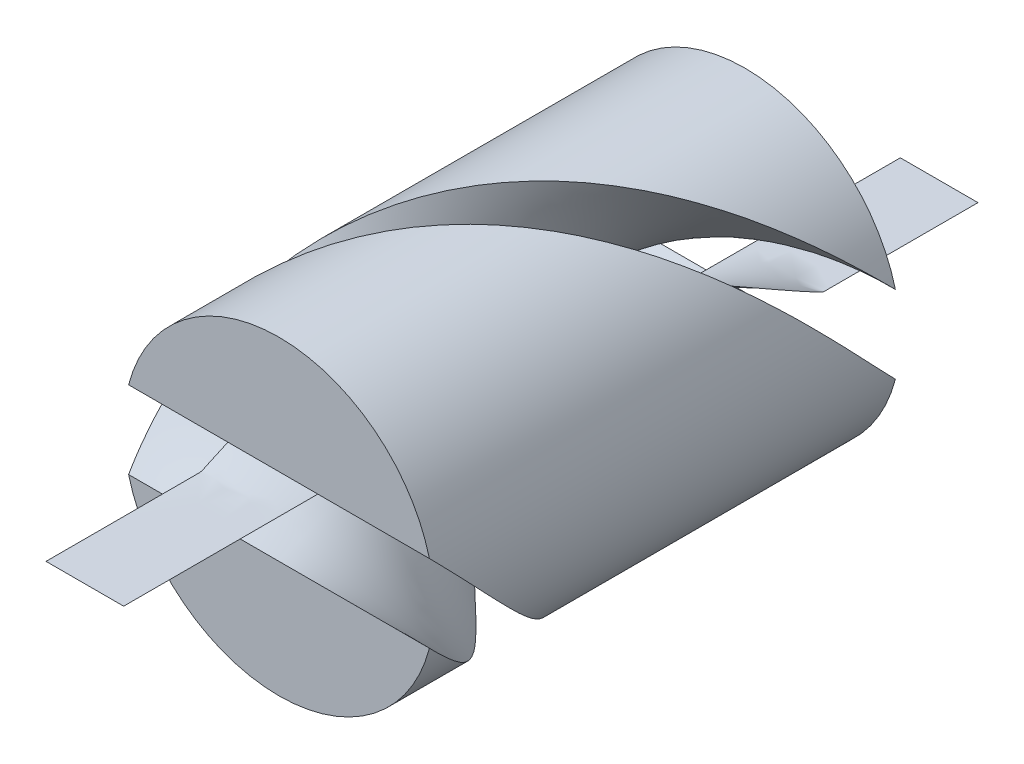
ISO-10303-21;
HEADER;
FILE_DESCRIPTION(('STEP AP214'),'2;1');
FILE_NAME('part.step','',(''),(''),'','','');
FILE_SCHEMA(('AUTOMOTIVE_DESIGN { 1 0 10303 214 1 1 1 1 }'));
ENDSEC;
DATA;
#1=APPLICATION_CONTEXT('core data for automotive mechanical design processes');
#2=APPLICATION_PROTOCOL_DEFINITION('international standard','automotive_design',2000,#1);
#3=PRODUCT_CONTEXT('',#1,'mechanical');
#4=PRODUCT('Part','Part','',(#3));
#5=PRODUCT_RELATED_PRODUCT_CATEGORY('part','',(#4));
#6=PRODUCT_DEFINITION_FORMATION('','',#4);
#7=PRODUCT_DEFINITION_CONTEXT('part definition',#1,'design');
#8=PRODUCT_DEFINITION('design','',#6,#7);
#9=PRODUCT_DEFINITION_SHAPE('','',#8);
#10=(LENGTH_UNIT() NAMED_UNIT(*) SI_UNIT(.MILLI.,.METRE.));
#11=(NAMED_UNIT(*) PLANE_ANGLE_UNIT() SI_UNIT($,.RADIAN.));
#12=(NAMED_UNIT(*) SI_UNIT($,.STERADIAN.) SOLID_ANGLE_UNIT());
#13=UNCERTAINTY_MEASURE_WITH_UNIT(LENGTH_MEASURE(1.E-05),#10,'distance_accuracy_value','');
#14=(GEOMETRIC_REPRESENTATION_CONTEXT(3) GLOBAL_UNCERTAINTY_ASSIGNED_CONTEXT((#13)) GLOBAL_UNIT_ASSIGNED_CONTEXT((#10,
#11,#12)) REPRESENTATION_CONTEXT('',''));
#15=CARTESIAN_POINT('',(0.,0.,0.));
#16=DIRECTION('',(0.,0.,1.));
#17=DIRECTION('',(1.,0.,0.));
#18=AXIS2_PLACEMENT_3D('',#15,#16,#17);
#19=CARTESIAN_POINT('',(0.,0.,-50.));
#20=CARTESIAN_POINT('',(0.,0.,-48.4768910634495));
#21=CARTESIAN_POINT('',(0.,0.,-45.430484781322));
#22=CARTESIAN_POINT('',(0.,0.,-39.9900949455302));
#23=CARTESIAN_POINT('',(0.,0.,-33.0262571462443));
#24=CARTESIAN_POINT('',(0.,0.,-25.1929118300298));
#25=CARTESIAN_POINT('',(0.,0.,-18.3952923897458));
#26=CARTESIAN_POINT('',(0.,0.,-12.9168424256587));
#27=CARTESIAN_POINT('',(0.,0.,-9.24643923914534));
#28=CARTESIAN_POINT('',(0.,0.,-5.14233388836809));
#29=CARTESIAN_POINT('',(0.,0.,-2.61760989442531));
#30=CARTESIAN_POINT('',(0.,0.,-0.405823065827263));
#31=CARTESIAN_POINT('',(0.,0.,0.214574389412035));
#32=CARTESIAN_POINT('',(0.,0.,2.12919861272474));
#33=CARTESIAN_POINT('',(0.,0.,4.70235845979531));
#34=CARTESIAN_POINT('',(0.,0.,7.63761814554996));
#35=CARTESIAN_POINT('',(0.,0.,12.61110313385));
#36=CARTESIAN_POINT('',(0.,0.,19.2754677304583));
#37=CARTESIAN_POINT('',(0.,0.,27.1694251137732));
#38=CARTESIAN_POINT('',(0.,0.,31.9046943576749));
#39=CARTESIAN_POINT('',(0.,0.,35.0294159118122));
#40=CARTESIAN_POINT('',(0.,0.,38.1541736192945));
#41=CARTESIAN_POINT('',(0.,0.,42.3726849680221));
#42=CARTESIAN_POINT('',(0.,0.,47.2475093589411));
#43=CARTESIAN_POINT('',(0.,0.,51.7474227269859));
#44=CARTESIAN_POINT('',(0.,0.,56.6223921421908));
#45=CARTESIAN_POINT('',(0.,0.,61.1224080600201));
#46=CARTESIAN_POINT('',(0.,0.,65.9974678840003));
#47=CARTESIAN_POINT('',(0.,0.,69.4037860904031));
#48=CARTESIAN_POINT('',(0.,0.,72.5288620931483));
#49=CARTESIAN_POINT('',(0.,0.,75.6539469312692));
#50=CARTESIAN_POINT('',(0.,0.,79.8728332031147));
#51=CARTESIAN_POINT('',(0.,0.,84.7480129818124));
#52=CARTESIAN_POINT('',(0.,0.,89.2481949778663));
#53=CARTESIAN_POINT('',(0.,0.,93.2327408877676));
#54=CARTESIAN_POINT('',(0.,0.,96.3578784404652));
#55=CARTESIAN_POINT('',(0.,0.,99.4830176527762));
#56=CARTESIAN_POINT('',(0.,0.,103.498822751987));
#57=CARTESIAN_POINT('',(0.,0.,106.905224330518));
#58=CARTESIAN_POINT('',(0.,0.,110.030359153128));
#59=CARTESIAN_POINT('',(0.,0.,113.155491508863));
#60=CARTESIAN_POINT('',(0.,0.,117.374408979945));
#61=CARTESIAN_POINT('',(0.,0.,122.249584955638));
#62=CARTESIAN_POINT('',(0.,0.,126.280968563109));
#63=CARTESIAN_POINT('',(0.,0.,129.406051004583));
#64=CARTESIAN_POINT('',(0.,0.,132.473315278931));
#65=CARTESIAN_POINT('',(0.,0.,135.963894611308));
#66=CARTESIAN_POINT('',(0.,0.,140.094681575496));
#67=CARTESIAN_POINT('',(0.,0.,143.40457905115));
#68=CARTESIAN_POINT('',(0.,0.,145.82046322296));
#69=CARTESIAN_POINT('',(0.,0.,147.127373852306));
#70=CARTESIAN_POINT('',(0.,0.,147.690270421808));
#71=CARTESIAN_POINT('',(0.,0.,148.251361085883));
#72=CARTESIAN_POINT('',(0.,0.,148.802743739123));
#73=CARTESIAN_POINT('',(0.,0.,149.850117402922));
#74=CARTESIAN_POINT('',(0.,0.,150.434966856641));
#75=CARTESIAN_POINT('',(0.,0.,152.24235765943));
#76=CARTESIAN_POINT('',(0.,0.,155.034863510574));
#77=CARTESIAN_POINT('',(0.,0.,160.478035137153));
#78=CARTESIAN_POINT('',(0.,0.,167.741070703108));
#79=CARTESIAN_POINT('',(0.,0.,175.835329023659));
#80=CARTESIAN_POINT('',(0.,0.,184.326458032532));
#81=CARTESIAN_POINT('',(0.,0.,190.967525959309));
#82=CARTESIAN_POINT('',(0.,0.,196.40942464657));
#83=CARTESIAN_POINT('',(0.,0.,198.803271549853));
#84=CARTESIAN_POINT('',(0.,0.,200.));
#85=CARTESIAN_POINT('',(8.33333333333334,0.,-50.));
#86=CARTESIAN_POINT('',(8.33333333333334,0.,-48.4768910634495));
#87=CARTESIAN_POINT('',(8.33333331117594,-1.32748074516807E-06,-45.4305533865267));
#88=CARTESIAN_POINT('',(8.33333322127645,-6.71349701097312E-06,-39.9904222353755));
#89=CARTESIAN_POINT('',(8.33333307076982,-1.57306140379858E-05,-33.0269605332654));
#90=CARTESIAN_POINT('',(8.33333296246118,-2.2219704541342E-05,-25.1936687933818));
#91=CARTESIAN_POINT('',(8.3333330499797,-1.69766395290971E-05,-18.3952891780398));
#92=CARTESIAN_POINT('',(8.33333327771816,-3.33284879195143E-06,-12.9155652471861));
#93=CARTESIAN_POINT('',(8.33333353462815,1.20586967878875E-05,-9.24387716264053));
#94=CARTESIAN_POINT('',(8.33333266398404,-0.000137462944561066,-5.15089769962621));
#95=CARTESIAN_POINT('',(8.33333114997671,-0.000368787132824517,-2.64351001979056));
#96=CARTESIAN_POINT('',(8.33328630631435,-0.00311461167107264,-0.398816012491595));
#97=CARTESIAN_POINT('',(8.33348864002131,0.0528383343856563,0.24476834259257));
#98=CARTESIAN_POINT('',(8.32880272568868,0.373681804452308,2.13310981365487));
#99=CARTESIAN_POINT('',(8.30122061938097,0.815717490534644,4.6932316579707));
#100=CARTESIAN_POINT('',(8.23054158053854,1.32420702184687,7.63055836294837));
#101=CARTESIAN_POINT('',(8.06832876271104,2.17814639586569,12.6070994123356));
#102=CARTESIAN_POINT('',(7.70671250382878,3.29179133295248,19.2740988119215));
#103=CARTESIAN_POINT('',(7.039178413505,4.50337086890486,27.169441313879));
#104=CARTESIAN_POINT('',(6.54342785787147,5.16586711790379,31.9051084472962));
#105=CARTESIAN_POINT('',(6.18927778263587,5.5802739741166,35.0300247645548));
#106=CARTESIAN_POINT('',(5.81701912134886,5.97890453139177,38.1549381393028));
#107=CARTESIAN_POINT('',(5.26762592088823,6.47038962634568,42.3735670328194));
#108=CARTESIAN_POINT('',(4.58083521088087,6.97375160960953,47.248443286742));
#109=CARTESIAN_POINT('',(3.90440887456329,7.37492677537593,51.7483514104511));
#110=CARTESIAN_POINT('',(3.13315816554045,7.7354592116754,56.6232912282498));
#111=CARTESIAN_POINT('',(2.39121224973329,7.99602499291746,61.123282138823));
#112=CARTESIAN_POINT('',(1.56403706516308,8.19788023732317,65.9983130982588));
#113=CARTESIAN_POINT('',(0.974733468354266,8.28153401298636,69.4046075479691));
#114=CARTESIAN_POINT('',(0.431126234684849,8.32315471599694,72.5296578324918));
#115=CARTESIAN_POINT('',(-0.114072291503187,8.34089946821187,75.6547141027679));
#116=CARTESIAN_POINT('',(-0.850109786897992,8.29902531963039,79.8735547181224));
#117=CARTESIAN_POINT('',(-1.69167947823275,8.16873712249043,84.7486744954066));
#118=CARTESIAN_POINT('',(-2.4537215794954,7.97409858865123,89.2487956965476));
#119=CARTESIAN_POINT('',(-3.10800436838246,7.73729527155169,93.2332844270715));
#120=CARTESIAN_POINT('',(-3.60646729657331,7.51602464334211,96.3583758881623));
#121=CARTESIAN_POINT('',(-4.09183258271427,7.26721491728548,99.4834683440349));
#122=CARTESIAN_POINT('',(-4.69136830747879,6.9032937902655,103.499210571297));
#123=CARTESIAN_POINT('',(-5.16737876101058,6.54579847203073,106.905552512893));
#124=CARTESIAN_POINT('',(-5.58142970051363,6.19093306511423,110.030626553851));
#125=CARTESIAN_POINT('',(-5.97979107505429,5.81810715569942,113.155693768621));
#126=CARTESIAN_POINT('',(-6.47108500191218,5.26827613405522,117.374525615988));
#127=CARTESIAN_POINT('',(-6.97430190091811,4.58122337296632,122.249635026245));
#128=CARTESIAN_POINT('',(-7.33353906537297,3.97512920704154,126.281009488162));
#129=CARTESIAN_POINT('',(-7.57155895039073,3.48430042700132,129.406131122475));
#130=CARTESIAN_POINT('',(-7.78383741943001,2.99294470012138,132.473461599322));
#131=CARTESIAN_POINT('',(-7.98695650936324,2.41778597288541,135.964144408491));
#132=CARTESIAN_POINT('',(-8.16193656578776,1.71780255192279,140.094972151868));
#133=CARTESIAN_POINT('',(-8.25896728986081,1.1480418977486,143.404784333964));
#134=CARTESIAN_POINT('',(-8.30375653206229,0.728701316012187,145.820504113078));
#135=CARTESIAN_POINT('',(-8.3185680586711,0.50111433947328,147.127280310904));
#136=CARTESIAN_POINT('',(-8.32358666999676,0.403020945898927,147.69011179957));
#137=CARTESIAN_POINT('',(-8.32826602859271,0.302703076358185,148.255640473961));
#138=CARTESIAN_POINT('',(-8.33120045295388,0.200369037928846,148.818132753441));
#139=CARTESIAN_POINT('',(-8.33378868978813,0.037677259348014,149.830963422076));
#140=CARTESIAN_POINT('',(-8.33333352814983,-8.55972984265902E-06,150.430243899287));
#141=CARTESIAN_POINT('',(-8.33333349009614,-6.8856692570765E-06,152.241285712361));
#142=CARTESIAN_POINT('',(-8.33333343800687,-4.59429157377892E-06,155.035683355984));
#143=CARTESIAN_POINT('',(-8.33333336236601,-1.26747906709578E-06,160.481337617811));
#144=CARTESIAN_POINT('',(-8.33333330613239,1.2045011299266E-06,167.745646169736));
#145=CARTESIAN_POINT('',(-8.33333329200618,1.82326722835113E-06,175.839226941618));
#146=CARTESIAN_POINT('',(-8.33333330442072,1.2743963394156E-06,184.328658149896));
#147=CARTESIAN_POINT('',(-8.33333332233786,4.84530694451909E-07,190.968307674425));
#148=CARTESIAN_POINT('',(-8.33333333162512,7.52610993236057E-08,196.409540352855));
#149=CARTESIAN_POINT('',(-8.33333333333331,0.,198.803271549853));
#150=CARTESIAN_POINT('',(-8.33333333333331,0.,200.));
#151=CARTESIAN_POINT('',(16.6666666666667,0.,-50.));
#152=CARTESIAN_POINT('',(16.6666666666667,0.,-48.4768910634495));
#153=CARTESIAN_POINT('',(16.6666666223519,-2.65496149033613E-06,-45.4306219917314));
#154=CARTESIAN_POINT('',(16.6666664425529,-1.34269940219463E-05,-39.9907495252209));
#155=CARTESIAN_POINT('',(16.6666661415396,-3.14612280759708E-05,-33.0276639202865));
#156=CARTESIAN_POINT('',(16.6666659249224,-4.44394090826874E-05,-25.1944257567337));
#157=CARTESIAN_POINT('',(16.6666660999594,-3.39532790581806E-05,-18.3952859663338));
#158=CARTESIAN_POINT('',(16.6666665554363,-6.66569758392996E-06,-12.9142880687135));
#159=CARTESIAN_POINT('',(16.6666670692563,2.41173935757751E-05,-9.24131508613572));
#160=CARTESIAN_POINT('',(16.6666653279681,-0.00027492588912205,-5.15946151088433));
#161=CARTESIAN_POINT('',(16.6666622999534,-0.000737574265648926,-2.66941014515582));
#162=CARTESIAN_POINT('',(16.6665726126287,-0.0062292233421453,-0.391808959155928));
#163=CARTESIAN_POINT('',(16.6669772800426,0.105676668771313,0.274962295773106));
#164=CARTESIAN_POINT('',(16.6576054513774,0.747363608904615,2.13702101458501));
#165=CARTESIAN_POINT('',(16.6024412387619,1.63143498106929,4.68410485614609));
#166=CARTESIAN_POINT('',(16.4610831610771,2.64841404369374,7.62349858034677));
#167=CARTESIAN_POINT('',(16.1366575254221,4.35629279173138,12.6030956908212));
#168=CARTESIAN_POINT('',(15.4134250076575,6.58358266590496,19.2727298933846));
#169=CARTESIAN_POINT('',(14.07835682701,9.00674173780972,27.1694575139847));
#170=CARTESIAN_POINT('',(13.0868557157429,10.3317342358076,31.9055225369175));
#171=CARTESIAN_POINT('',(12.3785555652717,11.1605479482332,35.0306336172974));
#172=CARTESIAN_POINT('',(11.6340382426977,11.9578090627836,38.1557026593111));
#173=CARTESIAN_POINT('',(10.5352518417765,12.9407792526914,42.3744490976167));
#174=CARTESIAN_POINT('',(9.16167042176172,13.9475032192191,47.2493772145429));
#175=CARTESIAN_POINT('',(7.80881774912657,14.7498535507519,51.7492800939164));
#176=CARTESIAN_POINT('',(6.26631633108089,15.4709184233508,56.6241903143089));
#177=CARTESIAN_POINT('',(4.78242449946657,15.9920499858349,61.124156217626));
#178=CARTESIAN_POINT('',(3.12807413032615,16.3957604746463,65.9991583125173));
#179=CARTESIAN_POINT('',(1.94946693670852,16.5630680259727,69.4054290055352));
#180=CARTESIAN_POINT('',(0.862252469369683,16.6463094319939,72.5304535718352));
#181=CARTESIAN_POINT('',(-0.228144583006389,16.6817989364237,75.6554812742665));
#182=CARTESIAN_POINT('',(-1.700219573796,16.5980506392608,79.8742762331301));
#183=CARTESIAN_POINT('',(-3.38335895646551,16.3374742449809,84.7493360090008));
#184=CARTESIAN_POINT('',(-4.90744315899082,15.9481971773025,89.2493964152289));
#185=CARTESIAN_POINT('',(-6.21600873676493,15.4745905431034,93.2338279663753));
#186=CARTESIAN_POINT('',(-7.21293459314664,15.0320492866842,96.3588733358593));
#187=CARTESIAN_POINT('',(-8.18366516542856,14.534429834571,99.4839190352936));
#188=CARTESIAN_POINT('',(-9.3827366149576,13.806587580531,103.499598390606));
#189=CARTESIAN_POINT('',(-10.3347575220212,13.0915969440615,106.905880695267));
#190=CARTESIAN_POINT('',(-11.1628594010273,12.3818661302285,110.030893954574));
#191=CARTESIAN_POINT('',(-11.9595821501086,11.6362143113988,113.15589602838));
#192=CARTESIAN_POINT('',(-12.9421700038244,10.5365522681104,117.374642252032));
#193=CARTESIAN_POINT('',(-13.9486038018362,9.16244674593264,122.249685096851));
#194=CARTESIAN_POINT('',(-14.667078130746,7.95025841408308,126.281050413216));
#195=CARTESIAN_POINT('',(-15.1431179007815,6.96860085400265,129.406211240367));
#196=CARTESIAN_POINT('',(-15.5676748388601,5.98588940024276,132.473607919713));
#197=CARTESIAN_POINT('',(-15.9739130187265,4.83557194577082,135.964394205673));
#198=CARTESIAN_POINT('',(-16.3238731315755,3.43560510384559,140.095262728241));
#199=CARTESIAN_POINT('',(-16.5179345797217,2.2960837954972,143.404989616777));
#200=CARTESIAN_POINT('',(-16.6075130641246,1.45740263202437,145.820545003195));
#201=CARTESIAN_POINT('',(-16.6371361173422,1.00222867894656,147.127186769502));
#202=CARTESIAN_POINT('',(-16.6471733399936,0.806041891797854,147.689953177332));
#203=CARTESIAN_POINT('',(-16.6565320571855,0.605406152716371,148.25991986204));
#204=CARTESIAN_POINT('',(-16.6624009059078,0.400738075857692,148.833521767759));
#205=CARTESIAN_POINT('',(-16.6675773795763,0.075354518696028,149.811809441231));
#206=CARTESIAN_POINT('',(-16.6666670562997,-1.71194596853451E-05,150.425520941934));
#207=CARTESIAN_POINT('',(-16.6666669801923,-1.37713385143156E-05,152.240213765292));
#208=CARTESIAN_POINT('',(-16.6666668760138,-9.18858314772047E-06,155.036503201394));
#209=CARTESIAN_POINT('',(-16.666666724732,-2.53495813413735E-06,160.484640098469));
#210=CARTESIAN_POINT('',(-16.6666666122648,2.4090022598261E-06,167.750221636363));
#211=CARTESIAN_POINT('',(-16.6666665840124,3.64653445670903E-06,175.843124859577));
#212=CARTESIAN_POINT('',(-16.6666666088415,2.54879267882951E-06,184.330858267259));
#213=CARTESIAN_POINT('',(-16.6666666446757,9.69061388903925E-07,190.969089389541));
#214=CARTESIAN_POINT('',(-16.6666666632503,1.50522198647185E-07,196.409656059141));
#215=CARTESIAN_POINT('',(-16.6666666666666,0.,198.803271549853));
#216=CARTESIAN_POINT('',(-16.6666666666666,0.,200.));
#217=CARTESIAN_POINT('',(25.,0.,-50.));
#218=CARTESIAN_POINT('',(25.,0.,-48.4768910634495));
#219=CARTESIAN_POINT('',(24.9999999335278,-3.98244223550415E-06,-45.4306905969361));
#220=CARTESIAN_POINT('',(24.9999996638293,-2.01404910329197E-05,-39.9910768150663));
#221=CARTESIAN_POINT('',(24.9999992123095,-4.71918421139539E-05,-33.0283673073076));
#222=CARTESIAN_POINT('',(24.9999988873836,-6.66591136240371E-05,-25.1951827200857));
#223=CARTESIAN_POINT('',(24.9999991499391,-5.09299185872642E-05,-18.3952827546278));
#224=CARTESIAN_POINT('',(24.9999998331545,-9.99854637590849E-06,-12.9130108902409));
#225=CARTESIAN_POINT('',(25.0000006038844,3.61760903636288E-05,-9.23875300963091));
#226=CARTESIAN_POINT('',(24.9999979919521,-0.000412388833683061,-5.16802532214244));
#227=CARTESIAN_POINT('',(24.9999934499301,-0.00110636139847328,-2.69531027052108));
#228=CARTESIAN_POINT('',(24.999858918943,-0.00934383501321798,-0.38480190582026));
#229=CARTESIAN_POINT('',(25.0004659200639,0.158515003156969,0.305156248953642));
#230=CARTESIAN_POINT('',(24.986408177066,1.12104541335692,2.14093221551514));
#231=CARTESIAN_POINT('',(24.9036618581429,2.44715247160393,4.67497805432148));
#232=CARTESIAN_POINT('',(24.6916247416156,3.97262106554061,7.61643879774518));
#233=CARTESIAN_POINT('',(24.2049862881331,6.53443918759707,12.5990919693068));
#234=CARTESIAN_POINT('',(23.1201375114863,9.87537399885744,19.2713609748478));
#235=CARTESIAN_POINT('',(21.117535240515,13.5101126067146,27.1694737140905));
#236=CARTESIAN_POINT('',(19.6302835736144,15.4976013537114,31.9059366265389));
#237=CARTESIAN_POINT('',(18.5678333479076,16.7408219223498,35.0312424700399));
#238=CARTESIAN_POINT('',(17.4510573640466,17.9367135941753,38.1564671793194));
#239=CARTESIAN_POINT('',(15.8028777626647,19.411168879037,42.375331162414));
#240=CARTESIAN_POINT('',(13.7425056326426,20.9212548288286,47.2503111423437));
#241=CARTESIAN_POINT('',(11.7132266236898,22.1247803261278,51.7502087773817));
#242=CARTESIAN_POINT('',(9.39947449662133,23.2063776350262,56.6250894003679));
#243=CARTESIAN_POINT('',(7.17363674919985,23.9880749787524,61.125030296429));
#244=CARTESIAN_POINT('',(4.69211119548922,24.5936407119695,66.0000035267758));
#245=CARTESIAN_POINT('',(2.92420040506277,24.8446020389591,69.4062504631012));
#246=CARTESIAN_POINT('',(1.29337870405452,24.9694641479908,72.5312493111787));
#247=CARTESIAN_POINT('',(-0.342216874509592,25.0226984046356,75.6562484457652));
#248=CARTESIAN_POINT('',(-2.55032936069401,24.8970759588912,79.8749977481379));
#249=CARTESIAN_POINT('',(-5.07503843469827,24.5062113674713,84.749997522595));
#250=CARTESIAN_POINT('',(-7.36116473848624,23.9222957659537,89.2499971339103));
#251=CARTESIAN_POINT('',(-9.32401310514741,23.2118858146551,93.2343715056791));
#252=CARTESIAN_POINT('',(-10.81940188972,22.5480739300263,96.3593707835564));
#253=CARTESIAN_POINT('',(-12.2754977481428,21.8016447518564,99.4843697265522));
#254=CARTESIAN_POINT('',(-14.0741049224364,20.7098813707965,103.499986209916));
#255=CARTESIAN_POINT('',(-15.5021362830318,19.6373954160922,106.906208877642));
#256=CARTESIAN_POINT('',(-16.7442891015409,18.5727991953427,110.031161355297));
#257=CARTESIAN_POINT('',(-17.9393732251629,17.4543214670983,113.156098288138));
#258=CARTESIAN_POINT('',(-19.4132550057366,15.8048284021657,117.374758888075));
#259=CARTESIAN_POINT('',(-20.9229057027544,13.743670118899,122.249735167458));
#260=CARTESIAN_POINT('',(-22.000617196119,11.9253876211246,126.281091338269));
#261=CARTESIAN_POINT('',(-22.7146768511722,10.452901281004,129.406291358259));
#262=CARTESIAN_POINT('',(-23.3515122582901,8.97883410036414,132.473754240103));
#263=CARTESIAN_POINT('',(-23.9608695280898,7.25335791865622,135.964644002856));
#264=CARTESIAN_POINT('',(-24.4858096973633,5.15340765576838,140.095553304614));
#265=CARTESIAN_POINT('',(-24.7769018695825,3.4441256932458,143.40519489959));
#266=CARTESIAN_POINT('',(-24.9112695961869,2.18610394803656,145.820585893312));
#267=CARTESIAN_POINT('',(-24.9557041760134,1.50334301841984,147.1270932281));
#268=CARTESIAN_POINT('',(-24.9707600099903,1.20906283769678,147.689794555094));
#269=CARTESIAN_POINT('',(-24.9847980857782,0.908109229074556,148.264199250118));
#270=CARTESIAN_POINT('',(-24.9936013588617,0.601107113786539,148.848910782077));
#271=CARTESIAN_POINT('',(-25.0013660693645,0.113031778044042,149.792655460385));
#272=CARTESIAN_POINT('',(-25.0000005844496,-2.56791895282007E-05,150.42079798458));
#273=CARTESIAN_POINT('',(-25.0000004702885,-2.06570077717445E-05,152.239141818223));
#274=CARTESIAN_POINT('',(-25.0000003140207,-1.37828747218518E-05,155.037323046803));
#275=CARTESIAN_POINT('',(-25.0000000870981,-3.80243720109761E-06,160.487942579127));
#276=CARTESIAN_POINT('',(-24.9999999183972,3.61350338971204E-06,167.754797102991));
#277=CARTESIAN_POINT('',(-24.9999998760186,5.46980168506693E-06,175.847022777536));
#278=CARTESIAN_POINT('',(-24.9999999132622,3.82318901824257E-06,184.333058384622));
#279=CARTESIAN_POINT('',(-24.9999999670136,1.4535920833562E-06,190.969871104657));
#280=CARTESIAN_POINT('',(-24.9999999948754,2.25783297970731E-07,196.409771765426));
#281=CARTESIAN_POINT('',(-25.,0.,198.803271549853));
#282=CARTESIAN_POINT('',(-25.,0.,200.));
#283=B_SPLINE_SURFACE_WITH_KNOTS('',3,3,((#19,#20,#21,#22,#23,#24,#25,#26,#27,#28,#29,#30,#31,
#32,#33,#34,#35,#36,#37,#38,#39,#40,#41,#42,#43,#44,#45,#46,#47,#48,#49,#50,#51,#52,#53,#54,#55,
#56,#57,#58,#59,#60,#61,#62,#63,#64,#65,#66,#67,#68,#69,#70,#71,#72,#73,#74,#75,#76,#77,#78,#79,
#80,#81,#82,#83,#84),(#85,#86,#87,#88,#89,#90,#91,#92,#93,#94,#95,#96,#97,#98,#99,#100,#101,
#102,#103,#104,#105,#106,#107,#108,#109,#110,#111,#112,#113,#114,#115,#116,#117,#118,#119,#120,
#121,#122,#123,#124,#125,#126,#127,#128,#129,#130,#131,#132,#133,#134,#135,#136,#137,#138,#139,
#140,#141,#142,#143,#144,#145,#146,#147,#148,#149,#150),(#151,#152,#153,#154,#155,#156,#157,
#158,#159,#160,#161,#162,#163,#164,#165,#166,#167,#168,#169,#170,#171,#172,#173,#174,#175,#176,
#177,#178,#179,#180,#181,#182,#183,#184,#185,#186,#187,#188,#189,#190,#191,#192,#193,#194,#195,
#196,#197,#198,#199,#200,#201,#202,#203,#204,#205,#206,#207,#208,#209,#210,#211,#212,#213,#214,
#215,#216),(#217,#218,#219,#220,#221,#222,#223,#224,#225,#226,#227,#228,#229,#230,#231,#232,
#233,#234,#235,#236,#237,#238,#239,#240,#241,#242,#243,#244,#245,#246,#247,#248,#249,#250,#251,
#252,#253,#254,#255,#256,#257,#258,#259,#260,#261,#262,#263,#264,#265,#266,#267,#268,#269,#270,
#271,#272,#273,#274,#275,#276,#277,#278,#279,#280,#281,#282)),.UNSPECIFIED.,.F.,.F.,.F.,(4,4),
(4,1,1,1,1,1,1,1,1,1,1,1,1,1,1,1,1,1,1,1,1,1,1,1,1,1,1,1,1,1,1,1,1,1,1,1,1,1,1,1,1,1,1,1,1,1,1,
1,1,2,1,1,1,2,1,1,1,1,1,1,1,4),(0.,1.),(0.,0.0176237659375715,0.0352475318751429,
0.0629420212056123,0.0981895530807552,0.125884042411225,0.141619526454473,0.161619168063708,
0.168393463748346,0.189696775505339,0.190504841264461,0.194619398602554,0.196314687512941,
0.213533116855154,0.226013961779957,0.23246055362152,0.274759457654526,0.307994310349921,
0.329498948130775,0.33295508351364,0.346395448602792,0.367900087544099,0.384796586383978,
0.406301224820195,0.423197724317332,0.444702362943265,0.461598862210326,0.483103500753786,
0.486559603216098,0.500000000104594,0.521504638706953,0.538401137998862,0.559905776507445,
0.576802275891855,0.587362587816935,0.598306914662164,0.61520341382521,0.636708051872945,
0.640164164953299,0.653604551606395,0.675109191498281,0.692005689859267,0.71351032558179,
0.724646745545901,0.730406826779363,0.751201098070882,0.767539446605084,0.781166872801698,
0.791874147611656,0.797226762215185,0.798791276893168,0.804203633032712,0.804225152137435,
0.81101930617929,0.825257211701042,0.843415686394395,0.874115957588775,0.909363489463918,
0.937057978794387,0.972305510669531,0.986152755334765,1.),.UNSPECIFIED.);
#284=DIRECTION('',(1.,0.,0.));
#285=VECTOR('',#284,1.);
#286=CARTESIAN_POINT('',(12.5,0.,-50.));
#287=LINE('',#286,#285);
#288=CARTESIAN_POINT('',(0.,0.,-50.));
#289=VERTEX_POINT('',#288);
#290=CARTESIAN_POINT('',(25.,0.,-50.));
#291=VERTEX_POINT('',#290);
#292=EDGE_CURVE('E14',#289,#291,#287,.T.);
#293=CARTESIAN_POINT('',(25.,0.,-50.));
#294=CARTESIAN_POINT('',(25.,0.,-48.4768910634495));
#295=CARTESIAN_POINT('',(24.9999999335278,-3.98244223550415E-06,-45.4306905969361));
#296=CARTESIAN_POINT('',(24.9999996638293,-2.01404910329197E-05,-39.9910768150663));
#297=CARTESIAN_POINT('',(24.9999992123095,-4.71918421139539E-05,-33.0283673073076));
#298=CARTESIAN_POINT('',(24.9999988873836,-6.66591136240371E-05,-25.1951827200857));
#299=CARTESIAN_POINT('',(24.9999991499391,-5.09299185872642E-05,-18.3952827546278));
#300=CARTESIAN_POINT('',(24.9999998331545,-9.99854637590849E-06,-12.9130108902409));
#301=CARTESIAN_POINT('',(25.0000006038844,3.61760903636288E-05,-9.23875300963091));
#302=CARTESIAN_POINT('',(24.9999979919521,-0.000412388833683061,-5.16802532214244));
#303=CARTESIAN_POINT('',(24.9999934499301,-0.00110636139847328,-2.69531027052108));
#304=CARTESIAN_POINT('',(24.999858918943,-0.00934383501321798,-0.38480190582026));
#305=CARTESIAN_POINT('',(25.0004659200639,0.158515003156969,0.305156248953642));
#306=CARTESIAN_POINT('',(24.986408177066,1.12104541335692,2.14093221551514));
#307=CARTESIAN_POINT('',(24.9036618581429,2.44715247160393,4.67497805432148));
#308=CARTESIAN_POINT('',(24.6916247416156,3.97262106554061,7.61643879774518));
#309=CARTESIAN_POINT('',(24.2049862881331,6.53443918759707,12.5990919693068));
#310=CARTESIAN_POINT('',(23.1201375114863,9.87537399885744,19.2713609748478));
#311=CARTESIAN_POINT('',(21.117535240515,13.5101126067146,27.1694737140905));
#312=CARTESIAN_POINT('',(19.6302835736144,15.4976013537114,31.9059366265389));
#313=CARTESIAN_POINT('',(18.5678333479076,16.7408219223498,35.0312424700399));
#314=CARTESIAN_POINT('',(17.4510573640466,17.9367135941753,38.1564671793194));
#315=CARTESIAN_POINT('',(15.8028777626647,19.411168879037,42.375331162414));
#316=CARTESIAN_POINT('',(13.7425056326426,20.9212548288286,47.2503111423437));
#317=CARTESIAN_POINT('',(11.7132266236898,22.1247803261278,51.7502087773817));
#318=CARTESIAN_POINT('',(9.39947449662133,23.2063776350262,56.6250894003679));
#319=CARTESIAN_POINT('',(7.17363674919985,23.9880749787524,61.125030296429));
#320=CARTESIAN_POINT('',(4.69211119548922,24.5936407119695,66.0000035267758));
#321=CARTESIAN_POINT('',(2.92420040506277,24.8446020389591,69.4062504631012));
#322=CARTESIAN_POINT('',(1.29337870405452,24.9694641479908,72.5312493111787));
#323=CARTESIAN_POINT('',(-0.342216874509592,25.0226984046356,75.6562484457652));
#324=CARTESIAN_POINT('',(-2.55032936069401,24.8970759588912,79.8749977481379));
#325=CARTESIAN_POINT('',(-5.07503843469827,24.5062113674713,84.749997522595));
#326=CARTESIAN_POINT('',(-7.36116473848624,23.9222957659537,89.2499971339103));
#327=CARTESIAN_POINT('',(-9.32401310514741,23.2118858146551,93.2343715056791));
#328=CARTESIAN_POINT('',(-10.81940188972,22.5480739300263,96.3593707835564));
#329=CARTESIAN_POINT('',(-12.2754977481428,21.8016447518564,99.4843697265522));
#330=CARTESIAN_POINT('',(-14.0741049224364,20.7098813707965,103.499986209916));
#331=CARTESIAN_POINT('',(-15.5021362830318,19.6373954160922,106.906208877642));
#332=CARTESIAN_POINT('',(-16.7442891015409,18.5727991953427,110.031161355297));
#333=CARTESIAN_POINT('',(-17.9393732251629,17.4543214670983,113.156098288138));
#334=CARTESIAN_POINT('',(-19.4132550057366,15.8048284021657,117.374758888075));
#335=CARTESIAN_POINT('',(-20.9229057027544,13.743670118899,122.249735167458));
#336=CARTESIAN_POINT('',(-22.000617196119,11.9253876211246,126.281091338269));
#337=CARTESIAN_POINT('',(-22.7146768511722,10.452901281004,129.406291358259));
#338=CARTESIAN_POINT('',(-23.3515122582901,8.97883410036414,132.473754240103));
#339=CARTESIAN_POINT('',(-23.9608695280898,7.25335791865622,135.964644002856));
#340=CARTESIAN_POINT('',(-24.4858096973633,5.15340765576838,140.095553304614));
#341=CARTESIAN_POINT('',(-24.7769018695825,3.4441256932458,143.40519489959));
#342=CARTESIAN_POINT('',(-24.9112695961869,2.18610394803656,145.820585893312));
#343=CARTESIAN_POINT('',(-24.9557041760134,1.50334301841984,147.1270932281));
#344=CARTESIAN_POINT('',(-24.9707600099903,1.20906283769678,147.689794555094));
#345=CARTESIAN_POINT('',(-24.9847980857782,0.908109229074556,148.264199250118));
#346=CARTESIAN_POINT('',(-24.9936013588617,0.601107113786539,148.848910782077));
#347=CARTESIAN_POINT('',(-25.0013660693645,0.113031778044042,149.792655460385));
#348=CARTESIAN_POINT('',(-25.0000005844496,-2.56791895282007E-05,150.42079798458));
#349=CARTESIAN_POINT('',(-25.0000004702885,-2.06570077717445E-05,152.239141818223));
#350=CARTESIAN_POINT('',(-25.0000003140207,-1.37828747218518E-05,155.037323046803));
#351=CARTESIAN_POINT('',(-25.0000000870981,-3.80243720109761E-06,160.487942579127));
#352=CARTESIAN_POINT('',(-24.9999999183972,3.61350338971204E-06,167.754797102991));
#353=CARTESIAN_POINT('',(-24.9999998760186,5.46980168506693E-06,175.847022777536));
#354=CARTESIAN_POINT('',(-24.9999999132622,3.82318901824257E-06,184.333058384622));
#355=CARTESIAN_POINT('',(-24.9999999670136,1.4535920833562E-06,190.969871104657));
#356=CARTESIAN_POINT('',(-24.9999999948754,2.25783297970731E-07,196.409771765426));
#357=CARTESIAN_POINT('',(-25.,0.,198.803271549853));
#358=CARTESIAN_POINT('',(-25.,0.,200.));
#359=B_SPLINE_CURVE_WITH_KNOTS('',3,(#293,#294,#295,#296,#297,#298,#299,#300,#301,#302,#303,
#304,#305,#306,#307,#308,#309,#310,#311,#312,#313,#314,#315,#316,#317,#318,#319,#320,#321,#322,
#323,#324,#325,#326,#327,#328,#329,#330,#331,#332,#333,#334,#335,#336,#337,#338,#339,#340,#341,
#342,#343,#344,#345,#346,#347,#348,#349,#350,#351,#352,#353,#354,#355,#356,#357,#358),
.UNSPECIFIED.,.F.,.F.,(4,1,1,1,1,1,1,1,1,1,1,1,1,1,1,1,1,1,1,1,1,1,1,1,1,1,1,1,1,1,1,1,1,1,1,1,
1,1,1,1,1,1,1,1,1,1,1,1,1,2,1,1,1,2,1,1,1,1,1,1,1,4),(0.,0.0176237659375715,0.0352475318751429,
0.0629420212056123,0.0981895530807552,0.125884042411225,0.141619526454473,0.161619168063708,
0.168393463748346,0.189696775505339,0.190504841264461,0.194619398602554,0.196314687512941,
0.213533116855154,0.226013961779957,0.23246055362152,0.274759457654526,0.307994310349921,
0.329498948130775,0.33295508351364,0.346395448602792,0.367900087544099,0.384796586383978,
0.406301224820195,0.423197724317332,0.444702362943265,0.461598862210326,0.483103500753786,
0.486559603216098,0.500000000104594,0.521504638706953,0.538401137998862,0.559905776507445,
0.576802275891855,0.587362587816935,0.598306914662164,0.61520341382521,0.636708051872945,
0.640164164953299,0.653604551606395,0.675109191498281,0.692005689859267,0.71351032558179,
0.724646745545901,0.730406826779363,0.751201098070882,0.767539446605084,0.781166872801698,
0.791874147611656,0.797226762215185,0.798791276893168,0.804203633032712,0.804225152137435,
0.81101930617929,0.825257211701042,0.843415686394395,0.874115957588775,0.909363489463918,
0.937057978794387,0.972305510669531,0.986152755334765,1.),.UNSPECIFIED.);
#360=CARTESIAN_POINT('',(-25.,0.,200.));
#361=VERTEX_POINT('',#360);
#362=EDGE_CURVE('E1468',#291,#361,#359,.T.);
#363=DIRECTION('',(1.,0.,0.));
#364=VECTOR('',#363,1.);
#365=CARTESIAN_POINT('',(-12.5,0.,200.));
#366=LINE('',#365,#364);
#367=CARTESIAN_POINT('',(0.,0.,200.));
#368=VERTEX_POINT('',#367);
#369=EDGE_CURVE('E1476',#361,#368,#366,.T.);
#370=DIRECTION('',(0.,0.,-1.));
#371=VECTOR('',#370,1.);
#372=CARTESIAN_POINT('',(0.,0.,74.9976810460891));
#373=LINE('',#372,#371);
#374=EDGE_CURVE('E1462',#368,#289,#373,.T.);
#375=ORIENTED_EDGE('',*,*,#292,.T.);
#376=ORIENTED_EDGE('',*,*,#362,.T.);
#377=ORIENTED_EDGE('',*,*,#369,.T.);
#378=ORIENTED_EDGE('',*,*,#374,.T.);
#379=EDGE_LOOP('',(#375,#376,#377,#378));
#380=FACE_BOUND('',#379,.T.);
#381=ADVANCED_FACE('F1459',(#380),#283,.T.);
#382=OPEN_SHELL('',(#381));
#383=SHELL_BASED_SURFACE_MODEL('B2',(#382));
#384=CARTESIAN_POINT('',(0.,0.,0.));
#385=DIRECTION('',(0.,0.,1.));
#386=DIRECTION('',(1.,0.,0.));
#387=AXIS2_PLACEMENT_3D('',#384,#385,#386);
#388=PLANE('',#387);
#389=CARTESIAN_POINT('',(48.4122918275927,-12.5,0.));
#390=CARTESIAN_POINT('',(-48.4122918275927,-12.5,0.));
#391=(BOUNDED_CURVE() B_SPLINE_CURVE(1,(#389,#390),.UNSPECIFIED.,.F.,
.F.) B_SPLINE_CURVE_WITH_KNOTS((2,2),(0.,1.),
.UNSPECIFIED.) CURVE() GEOMETRIC_REPRESENTATION_ITEM() RATIONAL_B_SPLINE_CURVE((1.,1.)) REPRESENTATION_ITEM(''));
#392=CARTESIAN_POINT('',(48.4122918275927,-12.5,0.));
#393=VERTEX_POINT('',#392);
#394=CARTESIAN_POINT('',(-48.4122918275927,-12.5,0.));
#395=VERTEX_POINT('',#394);
#396=EDGE_CURVE('E1457',#393,#395,#391,.T.);
#397=ORIENTED_EDGE('',*,*,#396,.F.);
#398=CARTESIAN_POINT('',(0.,0.,0.));
#399=DIRECTION('',(0.,0.,1.));
#400=DIRECTION('',(1.,0.,0.));
#401=AXIS2_PLACEMENT_3D('',#398,#399,#400);
#402=CIRCLE('',#401,50.);
#403=EDGE_CURVE('E1558',#395,#393,#402,.T.);
#404=ORIENTED_EDGE('',*,*,#403,.F.);
#405=EDGE_LOOP('',(#397,#404));
#406=FACE_BOUND('',#405,.T.);
#407=ADVANCED_FACE('F1521',(#406),#388,.F.);
#408=CARTESIAN_POINT('',(0.,0.,150.));
#409=DIRECTION('',(0.,0.,-1.));
#410=DIRECTION('',(-1.,0.,0.));
#411=AXIS2_PLACEMENT_3D('',#408,#409,#410);
#412=CYLINDRICAL_SURFACE('',#411,50.);
#413=CARTESIAN_POINT('',(48.4122918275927,-12.5,0.));
#414=CARTESIAN_POINT('',(50.2095205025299,-5.53936327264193,6.8181818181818));
#415=CARTESIAN_POINT('',(49.9729108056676,1.64565658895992,13.6363636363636));
#416=CARTESIAN_POINT('',(49.7363011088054,8.83067645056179,20.4545454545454));
#417=CARTESIAN_POINT('',(47.4850217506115,15.6579918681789,27.2727272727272));
#418=CARTESIAN_POINT('',(45.2337423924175,22.485307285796,34.090909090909));
#419=CARTESIAN_POINT('',(41.1501786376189,28.4018097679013,40.9090909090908));
#420=CARTESIAN_POINT('',(37.0666148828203,34.3183122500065,47.7272727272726));
#421=CARTESIAN_POINT('',(31.481592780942,38.8446819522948,54.5454545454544));
#422=CARTESIAN_POINT('',(25.8965706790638,43.3710516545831,61.3636363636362));
#423=CARTESIAN_POINT('',(19.2625555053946,46.1405890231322,68.181818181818));
#424=CARTESIAN_POINT('',(12.6285403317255,48.9101263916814,74.9999999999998));
#425=CARTESIAN_POINT('',(5.48298054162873,49.6984599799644,81.8181818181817));
#426=CARTESIAN_POINT('',(-1.66257924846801,50.4867935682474,88.6363636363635));
#427=CARTESIAN_POINT('',(-8.74079289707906,49.230057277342,95.4545454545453));
#428=CARTESIAN_POINT('',(-15.8190065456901,47.9733209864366,102.272727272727));
#429=CARTESIAN_POINT('',(-22.2564392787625,44.7733281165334,109.090909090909));
#430=CARTESIAN_POINT('',(-28.6938720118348,41.5733352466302,115.909090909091));
#431=CARTESIAN_POINT('',(-33.9690013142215,36.6893301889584,122.727272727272));
#432=CARTESIAN_POINT('',(-39.2441306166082,31.8053251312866,129.545454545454));
#433=CARTESIAN_POINT('',(-42.9295968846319,25.6329809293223,136.363636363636));
#434=CARTESIAN_POINT('',(-46.6150631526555,19.4606367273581,143.181818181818));
#435=CARTESIAN_POINT('',(-48.4122918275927,12.5,150.));
#436=CARTESIAN_POINT('',(-50.2095205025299,5.53936327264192,156.818181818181));
#437=CARTESIAN_POINT('',(-49.9729108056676,-1.64565658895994,163.636363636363));
#438=CARTESIAN_POINT('',(-49.7363011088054,-8.83067645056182,170.454545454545));
#439=CARTESIAN_POINT('',(-47.4850217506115,-15.6579918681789,177.272727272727));
#440=CARTESIAN_POINT('',(-45.2337423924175,-22.485307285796,184.090909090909));
#441=CARTESIAN_POINT('',(-41.1501786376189,-28.4018097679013,190.90909090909));
#442=CARTESIAN_POINT('',(-37.0666148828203,-34.3183122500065,197.727272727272));
#443=CARTESIAN_POINT('',(-31.481592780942,-38.8446819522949,204.545454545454));
#444=CARTESIAN_POINT('',(-25.8965706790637,-43.3710516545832,211.363636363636));
#445=CARTESIAN_POINT('',(-19.2625555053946,-46.1405890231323,218.181818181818));
#446=CARTESIAN_POINT('',(-12.6285403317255,-48.9101263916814,225.));
#447=CARTESIAN_POINT('',(-5.48298054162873,-49.6984599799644,231.818181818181));
#448=CARTESIAN_POINT('',(1.662579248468,-50.4867935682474,238.636363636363));
#449=CARTESIAN_POINT('',(8.74079289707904,-49.230057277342,245.454545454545));
#450=CARTESIAN_POINT('',(15.8190065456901,-47.9733209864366,252.272727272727));
#451=CARTESIAN_POINT('',(22.2564392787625,-44.7733281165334,259.090909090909));
#452=CARTESIAN_POINT('',(28.6938720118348,-41.5733352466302,265.90909090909));
#453=CARTESIAN_POINT('',(33.9690013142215,-36.6893301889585,272.727272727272));
#454=CARTESIAN_POINT('',(39.2441306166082,-31.8053251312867,279.545454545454));
#455=CARTESIAN_POINT('',(42.9295968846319,-25.6329809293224,286.363636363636));
#456=CARTESIAN_POINT('',(46.6150631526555,-19.4606367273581,293.181818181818));
#457=CARTESIAN_POINT('',(48.4122918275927,-12.5000000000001,299.999999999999));
#458=(BOUNDED_CURVE() B_SPLINE_CURVE(2,(#413,#414,#415,#416,#417,#418,#419,#420,#421,#422,#423,
#424,#425,#426,#427,#428,#429,#430,#431,#432,#433,#434,#435,#436,#437,#438,#439,#440,#441,#442,
#443,#444,#445,#446,#447,#448,#449,#450,#451,#452,#453,#454,#455,#456,#457),.UNSPECIFIED.,.F.,
.F.) B_SPLINE_CURVE_WITH_KNOTS((3,2,2,2,2,2,2,2,2,2,2,2,2,2,2,2,2,2,2,2,2,2,3),(0.,
0.0454545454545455,0.0909090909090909,0.136363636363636,0.181818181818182,0.227272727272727,
0.272727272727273,0.318181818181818,0.363636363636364,0.409090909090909,0.454545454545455,0.5,
0.545454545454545,0.590909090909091,0.636363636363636,0.681818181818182,0.727272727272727,
0.772727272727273,0.818181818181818,0.863636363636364,0.909090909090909,0.954545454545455,1.),
.UNSPECIFIED.) CURVE() GEOMETRIC_REPRESENTATION_ITEM() RATIONAL_B_SPLINE_CURVE((1.,
0.989821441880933,1.,0.989821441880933,1.,0.989821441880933,1.,0.989821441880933,1.,
0.989821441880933,1.,0.989821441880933,1.,0.989821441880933,1.,0.989821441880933,1.,
0.989821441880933,1.,0.989821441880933,1.,0.989821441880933,1.,0.989821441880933,1.,
0.989821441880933,1.,0.989821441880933,1.,0.989821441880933,1.,0.989821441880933,1.,
0.989821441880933,1.,0.989821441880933,1.,0.989821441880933,1.,0.989821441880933,1.,
0.989821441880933,1.,0.989821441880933,1.)) REPRESENTATION_ITEM(''));
#459=CARTESIAN_POINT('',(-48.4122918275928,12.4999999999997,150.));
#460=VERTEX_POINT('',#459);
#461=EDGE_CURVE('E1563',#393,#460,#458,.T.);
#462=ORIENTED_EDGE('',*,*,#461,.T.);
#463=CARTESIAN_POINT('',(0.,0.,150.));
#464=DIRECTION('',(0.,0.,1.));
#465=DIRECTION('',(1.,0.,0.));
#466=AXIS2_PLACEMENT_3D('',#463,#464,#465);
#467=CIRCLE('',#466,50.);
#468=CARTESIAN_POINT('',(48.4122918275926,12.5000000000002,150.));
#469=VERTEX_POINT('',#468);
#470=EDGE_CURVE('E1552',#469,#460,#467,.T.);
#471=ORIENTED_EDGE('',*,*,#470,.F.);
#472=CARTESIAN_POINT('',(-48.4122918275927,-12.5,0.));
#473=CARTESIAN_POINT('',(-46.6150631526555,-19.4606367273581,6.8181818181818));
#474=CARTESIAN_POINT('',(-42.9295968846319,-25.6329809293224,13.6363636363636));
#475=CARTESIAN_POINT('',(-39.2441306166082,-31.8053251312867,20.4545454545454));
#476=CARTESIAN_POINT('',(-33.9690013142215,-36.6893301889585,27.2727272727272));
#477=CARTESIAN_POINT('',(-28.6938720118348,-41.5733352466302,34.090909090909));
#478=CARTESIAN_POINT('',(-22.2564392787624,-44.7733281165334,40.9090909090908));
#479=CARTESIAN_POINT('',(-15.8190065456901,-47.9733209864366,47.7272727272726));
#480=CARTESIAN_POINT('',(-8.74079289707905,-49.230057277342,54.5454545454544));
#481=CARTESIAN_POINT('',(-1.662579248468,-50.4867935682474,61.3636363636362));
#482=CARTESIAN_POINT('',(5.48298054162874,-49.6984599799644,68.181818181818));
#483=CARTESIAN_POINT('',(12.6285403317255,-48.9101263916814,74.9999999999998));
#484=CARTESIAN_POINT('',(19.2625555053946,-46.1405890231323,81.8181818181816));
#485=CARTESIAN_POINT('',(25.8965706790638,-43.3710516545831,88.6363636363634));
#486=CARTESIAN_POINT('',(31.481592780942,-38.8446819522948,95.4545454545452));
#487=CARTESIAN_POINT('',(37.0666148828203,-34.3183122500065,102.272727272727));
#488=CARTESIAN_POINT('',(41.1501786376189,-28.4018097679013,109.090909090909));
#489=CARTESIAN_POINT('',(45.2337423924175,-22.485307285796,115.909090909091));
#490=CARTESIAN_POINT('',(47.4850217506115,-15.6579918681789,122.727272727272));
#491=CARTESIAN_POINT('',(49.7363011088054,-8.83067645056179,129.545454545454));
#492=CARTESIAN_POINT('',(49.9729108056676,-1.64565658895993,136.363636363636));
#493=CARTESIAN_POINT('',(50.2095205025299,5.53936327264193,143.181818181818));
#494=CARTESIAN_POINT('',(48.4122918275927,12.5,150.));
#495=CARTESIAN_POINT('',(46.6150631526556,19.4606367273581,156.818181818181));
#496=CARTESIAN_POINT('',(42.9295968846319,25.6329809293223,163.636363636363));
#497=CARTESIAN_POINT('',(39.2441306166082,31.8053251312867,170.454545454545));
#498=CARTESIAN_POINT('',(33.9690013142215,36.6893301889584,177.272727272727));
#499=CARTESIAN_POINT('',(28.6938720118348,41.5733352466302,184.090909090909));
#500=CARTESIAN_POINT('',(22.2564392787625,44.7733281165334,190.90909090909));
#501=CARTESIAN_POINT('',(15.8190065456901,47.9733209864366,197.727272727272));
#502=CARTESIAN_POINT('',(8.74079289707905,49.230057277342,204.545454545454));
#503=CARTESIAN_POINT('',(1.662579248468,50.4867935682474,211.363636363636));
#504=CARTESIAN_POINT('',(-5.48298054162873,49.6984599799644,218.181818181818));
#505=CARTESIAN_POINT('',(-12.6285403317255,48.9101263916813,225.));
#506=CARTESIAN_POINT('',(-19.2625555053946,46.1405890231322,231.818181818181));
#507=CARTESIAN_POINT('',(-25.8965706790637,43.3710516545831,238.636363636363));
#508=CARTESIAN_POINT('',(-31.481592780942,38.8446819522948,245.454545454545));
#509=CARTESIAN_POINT('',(-37.0666148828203,34.3183122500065,252.272727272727));
#510=CARTESIAN_POINT('',(-41.1501786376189,28.4018097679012,259.090909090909));
#511=CARTESIAN_POINT('',(-45.2337423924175,22.485307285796,265.90909090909));
#512=CARTESIAN_POINT('',(-47.4850217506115,15.6579918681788,272.727272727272));
#513=CARTESIAN_POINT('',(-49.7363011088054,8.83067645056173,279.545454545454));
#514=CARTESIAN_POINT('',(-49.9729108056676,1.64565658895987,286.363636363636));
#515=CARTESIAN_POINT('',(-50.2095205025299,-5.53936327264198,293.181818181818));
#516=CARTESIAN_POINT('',(-48.4122918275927,-12.5,299.999999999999));
#517=(BOUNDED_CURVE() B_SPLINE_CURVE(2,(#472,#473,#474,#475,#476,#477,#478,#479,#480,#481,#482,
#483,#484,#485,#486,#487,#488,#489,#490,#491,#492,#493,#494,#495,#496,#497,#498,#499,#500,#501,
#502,#503,#504,#505,#506,#507,#508,#509,#510,#511,#512,#513,#514,#515,#516),.UNSPECIFIED.,.F.,
.F.) B_SPLINE_CURVE_WITH_KNOTS((3,2,2,2,2,2,2,2,2,2,2,2,2,2,2,2,2,2,2,2,2,2,3),(0.,
0.0454545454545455,0.0909090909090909,0.136363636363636,0.181818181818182,0.227272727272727,
0.272727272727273,0.318181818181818,0.363636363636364,0.409090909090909,0.454545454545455,0.5,
0.545454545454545,0.590909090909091,0.636363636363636,0.681818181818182,0.727272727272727,
0.772727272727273,0.818181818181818,0.863636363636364,0.909090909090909,0.954545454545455,1.),
.UNSPECIFIED.) CURVE() GEOMETRIC_REPRESENTATION_ITEM() RATIONAL_B_SPLINE_CURVE((1.,
0.989821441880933,1.,0.989821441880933,1.,0.989821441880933,1.,0.989821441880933,1.,
0.989821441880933,1.,0.989821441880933,1.,0.989821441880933,1.,0.989821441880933,1.,
0.989821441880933,1.,0.989821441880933,1.,0.989821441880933,1.,0.989821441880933,1.,
0.989821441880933,1.,0.989821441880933,1.,0.989821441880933,1.,0.989821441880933,1.,
0.989821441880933,1.,0.989821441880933,1.,0.989821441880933,1.,0.989821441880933,1.,
0.989821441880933,1.,0.989821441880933,1.)) REPRESENTATION_ITEM(''));
#518=EDGE_CURVE('E1531',#395,#469,#517,.T.);
#519=ORIENTED_EDGE('',*,*,#518,.F.);
#520=ORIENTED_EDGE('',*,*,#403,.T.);
#521=EDGE_LOOP('',(#462,#471,#519,#520));
#522=FACE_BOUND('',#521,.T.);
#523=ADVANCED_FACE('F1562',(#522),#412,.T.);
#524=CARTESIAN_POINT('',(0.,0.,150.));
#525=DIRECTION('',(0.,0.,1.));
#526=DIRECTION('',(1.,0.,0.));
#527=AXIS2_PLACEMENT_3D('',#524,#525,#526);
#528=PLANE('',#527);
#529=DIRECTION('',(1.,0.,0.));
#530=VECTOR('',#529,1.);
#531=CARTESIAN_POINT('',(-48.4122918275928,12.4999999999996,150.));
#532=LINE('',#531,#530);
#533=EDGE_CURVE('E1545',#460,#469,#532,.T.);
#534=ORIENTED_EDGE('',*,*,#533,.T.);
#535=ORIENTED_EDGE('',*,*,#470,.T.);
#536=EDGE_LOOP('',(#534,#535));
#537=FACE_BOUND('',#536,.T.);
#538=ADVANCED_FACE('F1557',(#537),#528,.T.);
#539=CARTESIAN_POINT('',(48.4122918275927,-12.5,0.));
#540=CARTESIAN_POINT('',(50.2095205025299,-5.53936327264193,6.8181818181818));
#541=CARTESIAN_POINT('',(49.9729108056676,1.64565658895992,13.6363636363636));
#542=CARTESIAN_POINT('',(49.7363011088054,8.83067645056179,20.4545454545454));
#543=CARTESIAN_POINT('',(47.4850217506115,15.6579918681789,27.2727272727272));
#544=CARTESIAN_POINT('',(45.2337423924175,22.485307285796,34.090909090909));
#545=CARTESIAN_POINT('',(41.1501786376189,28.4018097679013,40.9090909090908));
#546=CARTESIAN_POINT('',(37.0666148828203,34.3183122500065,47.7272727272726));
#547=CARTESIAN_POINT('',(31.481592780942,38.8446819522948,54.5454545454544));
#548=CARTESIAN_POINT('',(25.8965706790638,43.3710516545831,61.3636363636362));
#549=CARTESIAN_POINT('',(19.2625555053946,46.1405890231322,68.181818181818));
#550=CARTESIAN_POINT('',(12.6285403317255,48.9101263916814,74.9999999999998));
#551=CARTESIAN_POINT('',(5.48298054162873,49.6984599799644,81.8181818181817));
#552=CARTESIAN_POINT('',(-1.66257924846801,50.4867935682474,88.6363636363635));
#553=CARTESIAN_POINT('',(-8.74079289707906,49.230057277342,95.4545454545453));
#554=CARTESIAN_POINT('',(-15.8190065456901,47.9733209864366,102.272727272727));
#555=CARTESIAN_POINT('',(-22.2564392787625,44.7733281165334,109.090909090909));
#556=CARTESIAN_POINT('',(-28.6938720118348,41.5733352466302,115.909090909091));
#557=CARTESIAN_POINT('',(-33.9690013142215,36.6893301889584,122.727272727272));
#558=CARTESIAN_POINT('',(-39.2441306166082,31.8053251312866,129.545454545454));
#559=CARTESIAN_POINT('',(-42.9295968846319,25.6329809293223,136.363636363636));
#560=CARTESIAN_POINT('',(-46.6150631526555,19.4606367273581,143.181818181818));
#561=CARTESIAN_POINT('',(-48.4122918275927,12.5,150.));
#562=CARTESIAN_POINT('',(-50.2095205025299,5.53936327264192,156.818181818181));
#563=CARTESIAN_POINT('',(-49.9729108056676,-1.64565658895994,163.636363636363));
#564=CARTESIAN_POINT('',(-49.7363011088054,-8.83067645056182,170.454545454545));
#565=CARTESIAN_POINT('',(-47.4850217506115,-15.6579918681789,177.272727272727));
#566=CARTESIAN_POINT('',(-45.2337423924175,-22.485307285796,184.090909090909));
#567=CARTESIAN_POINT('',(-41.1501786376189,-28.4018097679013,190.90909090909));
#568=CARTESIAN_POINT('',(-37.0666148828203,-34.3183122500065,197.727272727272));
#569=CARTESIAN_POINT('',(-31.481592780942,-38.8446819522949,204.545454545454));
#570=CARTESIAN_POINT('',(-25.8965706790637,-43.3710516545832,211.363636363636));
#571=CARTESIAN_POINT('',(-19.2625555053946,-46.1405890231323,218.181818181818));
#572=CARTESIAN_POINT('',(-12.6285403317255,-48.9101263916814,225.));
#573=CARTESIAN_POINT('',(-5.48298054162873,-49.6984599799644,231.818181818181));
#574=CARTESIAN_POINT('',(1.662579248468,-50.4867935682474,238.636363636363));
#575=CARTESIAN_POINT('',(8.74079289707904,-49.230057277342,245.454545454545));
#576=CARTESIAN_POINT('',(15.8190065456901,-47.9733209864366,252.272727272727));
#577=CARTESIAN_POINT('',(22.2564392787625,-44.7733281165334,259.090909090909));
#578=CARTESIAN_POINT('',(28.6938720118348,-41.5733352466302,265.90909090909));
#579=CARTESIAN_POINT('',(33.9690013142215,-36.6893301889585,272.727272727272));
#580=CARTESIAN_POINT('',(39.2441306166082,-31.8053251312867,279.545454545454));
#581=CARTESIAN_POINT('',(42.9295968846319,-25.6329809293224,286.363636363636));
#582=CARTESIAN_POINT('',(46.6150631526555,-19.4606367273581,293.181818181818));
#583=CARTESIAN_POINT('',(48.4122918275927,-12.5,299.999999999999));
#584=CARTESIAN_POINT('',(-48.4122918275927,-12.5,0.));
#585=CARTESIAN_POINT('',(-46.6150631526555,-19.4606367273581,6.8181818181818));
#586=CARTESIAN_POINT('',(-42.9295968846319,-25.6329809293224,13.6363636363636));
#587=CARTESIAN_POINT('',(-39.2441306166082,-31.8053251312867,20.4545454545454));
#588=CARTESIAN_POINT('',(-33.9690013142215,-36.6893301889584,27.2727272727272));
#589=CARTESIAN_POINT('',(-28.6938720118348,-41.5733352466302,34.090909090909));
#590=CARTESIAN_POINT('',(-22.2564392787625,-44.7733281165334,40.9090909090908));
#591=CARTESIAN_POINT('',(-15.8190065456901,-47.9733209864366,47.7272727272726));
#592=CARTESIAN_POINT('',(-8.74079289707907,-49.230057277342,54.5454545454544));
#593=CARTESIAN_POINT('',(-1.66257924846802,-50.4867935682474,61.3636363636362));
#594=CARTESIAN_POINT('',(5.48298054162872,-49.6984599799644,68.181818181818));
#595=CARTESIAN_POINT('',(12.6285403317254,-48.9101263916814,74.9999999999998));
#596=CARTESIAN_POINT('',(19.2625555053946,-46.1405890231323,81.8181818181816));
#597=CARTESIAN_POINT('',(25.8965706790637,-43.3710516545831,88.6363636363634));
#598=CARTESIAN_POINT('',(31.481592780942,-38.8446819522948,95.4545454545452));
#599=CARTESIAN_POINT('',(37.0666148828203,-34.3183122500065,102.272727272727));
#600=CARTESIAN_POINT('',(41.1501786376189,-28.4018097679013,109.090909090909));
#601=CARTESIAN_POINT('',(45.2337423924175,-22.4853072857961,115.909090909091));
#602=CARTESIAN_POINT('',(47.4850217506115,-15.6579918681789,122.727272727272));
#603=CARTESIAN_POINT('',(49.7363011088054,-8.8306764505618,129.545454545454));
#604=CARTESIAN_POINT('',(49.9729108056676,-1.64565658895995,136.363636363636));
#605=CARTESIAN_POINT('',(50.2095205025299,5.53936327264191,143.181818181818));
#606=CARTESIAN_POINT('',(48.4122918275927,12.5,150.));
#607=CARTESIAN_POINT('',(46.6150631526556,19.460636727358,156.818181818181));
#608=CARTESIAN_POINT('',(42.9295968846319,25.6329809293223,163.636363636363));
#609=CARTESIAN_POINT('',(39.2441306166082,31.8053251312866,170.454545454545));
#610=CARTESIAN_POINT('',(33.9690013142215,36.6893301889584,177.272727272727));
#611=CARTESIAN_POINT('',(28.6938720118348,41.5733352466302,184.090909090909));
#612=CARTESIAN_POINT('',(22.2564392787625,44.7733281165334,190.90909090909));
#613=CARTESIAN_POINT('',(15.8190065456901,47.9733209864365,197.727272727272));
#614=CARTESIAN_POINT('',(8.74079289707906,49.230057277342,204.545454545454));
#615=CARTESIAN_POINT('',(1.66257924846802,50.4867935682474,211.363636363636));
#616=CARTESIAN_POINT('',(-5.48298054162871,49.6984599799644,218.181818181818));
#617=CARTESIAN_POINT('',(-12.6285403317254,48.9101263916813,225.));
#618=CARTESIAN_POINT('',(-19.2625555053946,46.1405890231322,231.818181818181));
#619=CARTESIAN_POINT('',(-25.8965706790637,43.3710516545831,238.636363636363));
#620=CARTESIAN_POINT('',(-31.481592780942,38.8446819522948,245.454545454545));
#621=CARTESIAN_POINT('',(-37.0666148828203,34.3183122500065,252.272727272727));
#622=CARTESIAN_POINT('',(-41.1501786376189,28.4018097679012,259.090909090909));
#623=CARTESIAN_POINT('',(-45.2337423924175,22.485307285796,265.90909090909));
#624=CARTESIAN_POINT('',(-47.4850217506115,15.6579918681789,272.727272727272));
#625=CARTESIAN_POINT('',(-49.7363011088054,8.83067645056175,279.545454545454));
#626=CARTESIAN_POINT('',(-49.9729108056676,1.64565658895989,286.363636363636));
#627=CARTESIAN_POINT('',(-50.2095205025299,-5.53936327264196,293.181818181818));
#628=CARTESIAN_POINT('',(-48.4122918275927,-12.5,299.999999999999));
#629=(BOUNDED_SURFACE() B_SPLINE_SURFACE(1,2,((#539,#540,#541,#542,#543,#544,#545,#546,#547,
#548,#549,#550,#551,#552,#553,#554,#555,#556,#557,#558,#559,#560,#561,#562,#563,#564,#565,#566,
#567,#568,#569,#570,#571,#572,#573,#574,#575,#576,#577,#578,#579,#580,#581,#582,#583),(#584,
#585,#586,#587,#588,#589,#590,#591,#592,#593,#594,#595,#596,#597,#598,#599,#600,#601,#602,#603,
#604,#605,#606,#607,#608,#609,#610,#611,#612,#613,#614,#615,#616,#617,#618,#619,#620,#621,#622,
#623,#624,#625,#626,#627,#628)),.UNSPECIFIED.,.F.,.F.,.F.) B_SPLINE_SURFACE_WITH_KNOTS((2,2),(3,
2,2,2,2,2,2,2,2,2,2,2,2,2,2,2,2,2,2,2,2,2,3),(0.,1.),(0.,0.0454545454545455,0.0909090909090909,
0.136363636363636,0.181818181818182,0.227272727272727,0.272727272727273,0.318181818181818,
0.363636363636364,0.409090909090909,0.454545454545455,0.5,0.545454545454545,0.590909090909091,
0.636363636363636,0.681818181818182,0.727272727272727,0.772727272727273,0.818181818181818,
0.863636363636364,0.909090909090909,0.954545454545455,1.),
.UNSPECIFIED.) GEOMETRIC_REPRESENTATION_ITEM() RATIONAL_B_SPLINE_SURFACE(((1.,0.989821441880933,
1.,0.989821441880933,1.,0.989821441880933,1.,0.989821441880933,1.,0.989821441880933,1.,
0.989821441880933,1.,0.989821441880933,1.,0.989821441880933,1.,0.989821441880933,1.,
0.989821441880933,1.,0.989821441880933,1.,0.989821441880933,1.,0.989821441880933,1.,
0.989821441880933,1.,0.989821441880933,1.,0.989821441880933,1.,0.989821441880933,1.,
0.989821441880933,1.,0.989821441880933,1.,0.989821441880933,1.,0.989821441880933,1.,
0.989821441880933,1.),(1.,0.989821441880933,1.,0.989821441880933,1.,0.989821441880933,1.,
0.989821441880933,1.,0.989821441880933,1.,0.989821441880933,1.,0.989821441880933,1.,
0.989821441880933,1.,0.989821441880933,1.,0.989821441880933,1.,0.989821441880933,1.,
0.989821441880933,1.,0.989821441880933,1.,0.989821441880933,1.,0.989821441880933,1.,
0.989821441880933,1.,0.989821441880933,1.,0.989821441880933,1.,0.989821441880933,1.,
0.989821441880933,1.,0.989821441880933,1.,0.989821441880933,1.))) REPRESENTATION_ITEM('') SURFACE());
#630=ORIENTED_EDGE('',*,*,#518,.T.);
#631=ORIENTED_EDGE('',*,*,#533,.F.);
#632=ORIENTED_EDGE('',*,*,#461,.F.);
#633=ORIENTED_EDGE('',*,*,#396,.T.);
#634=EDGE_LOOP('',(#630,#631,#632,#633));
#635=FACE_BOUND('',#634,.T.);
#636=ADVANCED_FACE('F1544',(#635),#629,.T.);
#637=CLOSED_SHELL('',(#407,#523,#538,#636));
#638=MANIFOLD_SOLID_BREP('B8',#637);
#639=CARTESIAN_POINT('',(0.,0.,150.));
#640=DIRECTION('',(0.,0.,-1.));
#641=DIRECTION('',(-1.,0.,0.));
#642=AXIS2_PLACEMENT_3D('',#639,#640,#641);
#643=CYLINDRICAL_SURFACE('',#642,50.);
#644=CARTESIAN_POINT('',(-48.4122918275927,12.5,0.));
#645=CARTESIAN_POINT('',(-50.2095205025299,5.53936327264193,6.8181818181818));
#646=CARTESIAN_POINT('',(-49.9729108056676,-1.64565658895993,13.6363636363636));
#647=CARTESIAN_POINT('',(-49.7363011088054,-8.83067645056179,20.4545454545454));
#648=CARTESIAN_POINT('',(-47.4850217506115,-15.6579918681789,27.2727272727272));
#649=CARTESIAN_POINT('',(-45.2337423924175,-22.485307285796,34.090909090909));
#650=CARTESIAN_POINT('',(-41.1501786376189,-28.4018097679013,40.9090909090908));
#651=CARTESIAN_POINT('',(-37.0666148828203,-34.3183122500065,47.7272727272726));
#652=CARTESIAN_POINT('',(-31.481592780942,-38.8446819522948,54.5454545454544));
#653=CARTESIAN_POINT('',(-25.8965706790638,-43.3710516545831,61.3636363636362));
#654=CARTESIAN_POINT('',(-19.2625555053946,-46.1405890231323,68.181818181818));
#655=CARTESIAN_POINT('',(-12.6285403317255,-48.9101263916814,74.9999999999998));
#656=CARTESIAN_POINT('',(-5.48298054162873,-49.6984599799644,81.8181818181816));
#657=CARTESIAN_POINT('',(1.66257924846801,-50.4867935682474,88.6363636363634));
#658=CARTESIAN_POINT('',(8.74079289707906,-49.230057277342,95.4545454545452));
#659=CARTESIAN_POINT('',(15.8190065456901,-47.9733209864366,102.272727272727));
#660=CARTESIAN_POINT('',(22.2564392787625,-44.7733281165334,109.090909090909));
#661=CARTESIAN_POINT('',(28.6938720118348,-41.5733352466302,115.909090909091));
#662=CARTESIAN_POINT('',(33.9690013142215,-36.6893301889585,122.727272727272));
#663=CARTESIAN_POINT('',(39.2441306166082,-31.8053251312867,129.545454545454));
#664=CARTESIAN_POINT('',(42.9295968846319,-25.6329809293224,136.363636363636));
#665=CARTESIAN_POINT('',(46.6150631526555,-19.4606367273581,143.181818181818));
#666=CARTESIAN_POINT('',(48.4122918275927,-12.5,150.));
#667=CARTESIAN_POINT('',(50.2095205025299,-5.53936327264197,156.818181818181));
#668=CARTESIAN_POINT('',(49.9729108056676,1.64565658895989,163.636363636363));
#669=CARTESIAN_POINT('',(49.7363011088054,8.83067645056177,170.454545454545));
#670=CARTESIAN_POINT('',(47.4850217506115,15.6579918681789,177.272727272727));
#671=CARTESIAN_POINT('',(45.2337423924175,22.485307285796,184.090909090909));
#672=CARTESIAN_POINT('',(41.1501786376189,28.4018097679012,190.90909090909));
#673=CARTESIAN_POINT('',(37.0666148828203,34.3183122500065,197.727272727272));
#674=CARTESIAN_POINT('',(31.481592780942,38.8446819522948,204.545454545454));
#675=CARTESIAN_POINT('',(25.8965706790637,43.3710516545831,211.363636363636));
#676=CARTESIAN_POINT('',(19.2625555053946,46.1405890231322,218.181818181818));
#677=CARTESIAN_POINT('',(12.6285403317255,48.9101263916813,225.));
#678=CARTESIAN_POINT('',(5.48298054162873,49.6984599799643,231.818181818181));
#679=CARTESIAN_POINT('',(-1.662579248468,50.4867935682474,238.636363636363));
#680=CARTESIAN_POINT('',(-8.74079289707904,49.230057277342,245.454545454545));
#681=CARTESIAN_POINT('',(-15.8190065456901,47.9733209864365,252.272727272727));
#682=CARTESIAN_POINT('',(-22.2564392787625,44.7733281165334,259.090909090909));
#683=CARTESIAN_POINT('',(-28.6938720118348,41.5733352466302,265.90909090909));
#684=CARTESIAN_POINT('',(-33.9690013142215,36.6893301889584,272.727272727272));
#685=CARTESIAN_POINT('',(-39.2441306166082,31.8053251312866,279.545454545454));
#686=CARTESIAN_POINT('',(-42.9295968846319,25.6329809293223,286.363636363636));
#687=CARTESIAN_POINT('',(-46.6150631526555,19.460636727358,293.181818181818));
#688=CARTESIAN_POINT('',(-48.4122918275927,12.5,299.999999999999));
#689=(BOUNDED_CURVE() B_SPLINE_CURVE(2,(#644,#645,#646,#647,#648,#649,#650,#651,#652,#653,#654,
#655,#656,#657,#658,#659,#660,#661,#662,#663,#664,#665,#666,#667,#668,#669,#670,#671,#672,#673,
#674,#675,#676,#677,#678,#679,#680,#681,#682,#683,#684,#685,#686,#687,#688),.UNSPECIFIED.,.F.,
.F.) B_SPLINE_CURVE_WITH_KNOTS((3,2,2,2,2,2,2,2,2,2,2,2,2,2,2,2,2,2,2,2,2,2,3),(0.,
0.0454545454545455,0.0909090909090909,0.136363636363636,0.181818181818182,0.227272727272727,
0.272727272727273,0.318181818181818,0.363636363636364,0.409090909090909,0.454545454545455,0.5,
0.545454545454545,0.590909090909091,0.636363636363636,0.681818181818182,0.727272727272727,
0.772727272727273,0.818181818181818,0.863636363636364,0.909090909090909,0.954545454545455,1.),
.UNSPECIFIED.) CURVE() GEOMETRIC_REPRESENTATION_ITEM() RATIONAL_B_SPLINE_CURVE((1.,
0.989821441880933,1.,0.989821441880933,1.,0.989821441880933,1.,0.989821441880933,1.,
0.989821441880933,1.,0.989821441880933,1.,0.989821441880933,1.,0.989821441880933,1.,
0.989821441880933,1.,0.989821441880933,1.,0.989821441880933,1.,0.989821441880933,1.,
0.989821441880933,1.,0.989821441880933,1.,0.989821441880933,1.,0.989821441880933,1.,
0.989821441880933,1.,0.989821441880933,1.,0.989821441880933,1.,0.989821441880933,1.,
0.989821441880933,1.,0.989821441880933,1.)) REPRESENTATION_ITEM(''));
#690=CARTESIAN_POINT('',(-48.4122918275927,12.5,0.));
#691=VERTEX_POINT('',#690);
#692=CARTESIAN_POINT('',(48.4122918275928,-12.4999999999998,150.));
#693=VERTEX_POINT('',#692);
#694=EDGE_CURVE('E1682',#691,#693,#689,.T.);
#695=ORIENTED_EDGE('',*,*,#694,.T.);
#696=CARTESIAN_POINT('',(0.,0.,150.));
#697=DIRECTION('',(0.,0.,1.));
#698=DIRECTION('',(1.,0.,0.));
#699=AXIS2_PLACEMENT_3D('',#696,#697,#698);
#700=CIRCLE('',#699,50.);
#701=CARTESIAN_POINT('',(-48.4122918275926,-12.5000000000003,150.));
#702=VERTEX_POINT('',#701);
#703=EDGE_CURVE('E1519',#702,#693,#700,.T.);
#704=ORIENTED_EDGE('',*,*,#703,.F.);
#705=CARTESIAN_POINT('',(48.4122918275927,12.5,0.));
#706=CARTESIAN_POINT('',(46.6150631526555,19.4606367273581,6.8181818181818));
#707=CARTESIAN_POINT('',(42.9295968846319,25.6329809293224,13.6363636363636));
#708=CARTESIAN_POINT('',(39.2441306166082,31.8053251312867,20.4545454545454));
#709=CARTESIAN_POINT('',(33.9690013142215,36.6893301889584,27.2727272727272));
#710=CARTESIAN_POINT('',(28.6938720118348,41.5733352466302,34.090909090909));
#711=CARTESIAN_POINT('',(22.2564392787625,44.7733281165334,40.9090909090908));
#712=CARTESIAN_POINT('',(15.8190065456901,47.9733209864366,47.7272727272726));
#713=CARTESIAN_POINT('',(8.74079289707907,49.230057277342,54.5454545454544));
#714=CARTESIAN_POINT('',(1.66257924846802,50.4867935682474,61.3636363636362));
#715=CARTESIAN_POINT('',(-5.48298054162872,49.6984599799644,68.181818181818));
#716=CARTESIAN_POINT('',(-12.6285403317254,48.9101263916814,74.9999999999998));
#717=CARTESIAN_POINT('',(-19.2625555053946,46.1405890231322,81.8181818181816));
#718=CARTESIAN_POINT('',(-25.8965706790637,43.3710516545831,88.6363636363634));
#719=CARTESIAN_POINT('',(-31.481592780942,38.8446819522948,95.4545454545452));
#720=CARTESIAN_POINT('',(-37.0666148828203,34.3183122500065,102.272727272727));
#721=CARTESIAN_POINT('',(-41.1501786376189,28.4018097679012,109.090909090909));
#722=CARTESIAN_POINT('',(-45.2337423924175,22.485307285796,115.909090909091));
#723=CARTESIAN_POINT('',(-47.4850217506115,15.6579918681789,122.727272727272));
#724=CARTESIAN_POINT('',(-49.7363011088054,8.83067645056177,129.545454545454));
#725=CARTESIAN_POINT('',(-49.9729108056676,1.64565658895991,136.363636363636));
#726=CARTESIAN_POINT('',(-50.2095205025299,-5.53936327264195,143.181818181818));
#727=CARTESIAN_POINT('',(-48.4122918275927,-12.5,150.));
#728=CARTESIAN_POINT('',(-46.6150631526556,-19.4606367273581,156.818181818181));
#729=CARTESIAN_POINT('',(-42.9295968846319,-25.6329809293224,163.636363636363));
#730=CARTESIAN_POINT('',(-39.2441306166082,-31.8053251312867,170.454545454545));
#731=CARTESIAN_POINT('',(-33.9690013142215,-36.6893301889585,177.272727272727));
#732=CARTESIAN_POINT('',(-28.6938720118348,-41.5733352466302,184.090909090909));
#733=CARTESIAN_POINT('',(-22.2564392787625,-44.7733281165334,190.90909090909));
#734=CARTESIAN_POINT('',(-15.8190065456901,-47.9733209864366,197.727272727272));
#735=CARTESIAN_POINT('',(-8.74079289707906,-49.230057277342,204.545454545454));
#736=CARTESIAN_POINT('',(-1.66257924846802,-50.4867935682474,211.363636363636));
#737=CARTESIAN_POINT('',(5.48298054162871,-49.6984599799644,218.181818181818));
#738=CARTESIAN_POINT('',(12.6285403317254,-48.9101263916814,225.));
#739=CARTESIAN_POINT('',(19.2625555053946,-46.1405890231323,231.818181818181));
#740=CARTESIAN_POINT('',(25.8965706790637,-43.3710516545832,238.636363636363));
#741=CARTESIAN_POINT('',(31.481592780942,-38.8446819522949,245.454545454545));
#742=CARTESIAN_POINT('',(37.0666148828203,-34.3183122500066,252.272727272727));
#743=CARTESIAN_POINT('',(41.1501786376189,-28.4018097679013,259.090909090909));
#744=CARTESIAN_POINT('',(45.2337423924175,-22.4853072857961,265.90909090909));
#745=CARTESIAN_POINT('',(47.4850217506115,-15.6579918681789,272.727272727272));
#746=CARTESIAN_POINT('',(49.7363011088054,-8.83067645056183,279.545454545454));
#747=CARTESIAN_POINT('',(49.9729108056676,-1.64565658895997,286.363636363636));
#748=CARTESIAN_POINT('',(50.2095205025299,5.53936327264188,293.181818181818));
#749=CARTESIAN_POINT('',(48.4122918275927,12.4999999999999,299.999999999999));
#750=(BOUNDED_CURVE() B_SPLINE_CURVE(2,(#705,#706,#707,#708,#709,#710,#711,#712,#713,#714,#715,
#716,#717,#718,#719,#720,#721,#722,#723,#724,#725,#726,#727,#728,#729,#730,#731,#732,#733,#734,
#735,#736,#737,#738,#739,#740,#741,#742,#743,#744,#745,#746,#747,#748,#749),.UNSPECIFIED.,.F.,
.F.) B_SPLINE_CURVE_WITH_KNOTS((3,2,2,2,2,2,2,2,2,2,2,2,2,2,2,2,2,2,2,2,2,2,3),(0.,
0.0454545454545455,0.0909090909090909,0.136363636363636,0.181818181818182,0.227272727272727,
0.272727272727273,0.318181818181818,0.363636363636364,0.409090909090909,0.454545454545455,0.5,
0.545454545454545,0.590909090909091,0.636363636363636,0.681818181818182,0.727272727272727,
0.772727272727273,0.818181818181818,0.863636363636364,0.909090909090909,0.954545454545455,1.),
.UNSPECIFIED.) CURVE() GEOMETRIC_REPRESENTATION_ITEM() RATIONAL_B_SPLINE_CURVE((1.,
0.989821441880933,1.,0.989821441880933,1.,0.989821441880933,1.,0.989821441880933,1.,
0.989821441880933,1.,0.989821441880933,1.,0.989821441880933,1.,0.989821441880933,1.,
0.989821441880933,1.,0.989821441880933,1.,0.989821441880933,1.,0.989821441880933,1.,
0.989821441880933,1.,0.989821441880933,1.,0.989821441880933,1.,0.989821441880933,1.,
0.989821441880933,1.,0.989821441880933,1.,0.989821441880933,1.,0.989821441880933,1.,
0.989821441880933,1.,0.989821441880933,1.)) REPRESENTATION_ITEM(''));
#751=CARTESIAN_POINT('',(48.4122918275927,12.5,0.));
#752=VERTEX_POINT('',#751);
#753=EDGE_CURVE('E1687',#752,#702,#750,.T.);
#754=ORIENTED_EDGE('',*,*,#753,.F.);
#755=CARTESIAN_POINT('',(0.,0.,0.));
#756=DIRECTION('',(0.,0.,1.));
#757=DIRECTION('',(1.,0.,0.));
#758=AXIS2_PLACEMENT_3D('',#755,#756,#757);
#759=CIRCLE('',#758,50.);
#760=EDGE_CURVE('E1663',#752,#691,#759,.T.);
#761=ORIENTED_EDGE('',*,*,#760,.T.);
#762=EDGE_LOOP('',(#695,#704,#754,#761));
#763=FACE_BOUND('',#762,.T.);
#764=ADVANCED_FACE('F1653',(#763),#643,.T.);
#765=CARTESIAN_POINT('',(0.,0.,150.));
#766=DIRECTION('',(0.,0.,1.));
#767=DIRECTION('',(1.,0.,0.));
#768=AXIS2_PLACEMENT_3D('',#765,#766,#767);
#769=PLANE('',#768);
#770=DIRECTION('',(-1.,0.,0.));
#771=VECTOR('',#770,1.);
#772=CARTESIAN_POINT('',(-48.4122918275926,-12.5000000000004,150.));
#773=LINE('',#772,#771);
#774=EDGE_CURVE('E1677',#693,#702,#773,.T.);
#775=ORIENTED_EDGE('',*,*,#774,.T.);
#776=ORIENTED_EDGE('',*,*,#703,.T.);
#777=EDGE_LOOP('',(#775,#776));
#778=FACE_BOUND('',#777,.T.);
#779=ADVANCED_FACE('F1704',(#778),#769,.T.);
#780=CARTESIAN_POINT('',(0.,0.,0.));
#781=DIRECTION('',(0.,0.,1.));
#782=DIRECTION('',(1.,0.,0.));
#783=AXIS2_PLACEMENT_3D('',#780,#781,#782);
#784=PLANE('',#783);
#785=CARTESIAN_POINT('',(-48.4122918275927,12.5,0.));
#786=CARTESIAN_POINT('',(48.4122918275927,12.5,0.));
#787=(BOUNDED_CURVE() B_SPLINE_CURVE(1,(#785,#786),.UNSPECIFIED.,.F.,
.F.) B_SPLINE_CURVE_WITH_KNOTS((2,2),(0.,1.),
.UNSPECIFIED.) CURVE() GEOMETRIC_REPRESENTATION_ITEM() RATIONAL_B_SPLINE_CURVE((1.,1.)) REPRESENTATION_ITEM(''));
#788=EDGE_CURVE('E1671',#691,#752,#787,.T.);
#789=ORIENTED_EDGE('',*,*,#788,.F.);
#790=ORIENTED_EDGE('',*,*,#760,.F.);
#791=EDGE_LOOP('',(#789,#790));
#792=FACE_BOUND('',#791,.T.);
#793=ADVANCED_FACE('F1692',(#792),#784,.F.);
#794=CARTESIAN_POINT('',(-48.4122918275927,12.5,0.));
#795=CARTESIAN_POINT('',(-50.2095205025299,5.53936327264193,6.8181818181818));
#796=CARTESIAN_POINT('',(-49.9729108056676,-1.64565658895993,13.6363636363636));
#797=CARTESIAN_POINT('',(-49.7363011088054,-8.83067645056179,20.4545454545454));
#798=CARTESIAN_POINT('',(-47.4850217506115,-15.6579918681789,27.2727272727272));
#799=CARTESIAN_POINT('',(-45.2337423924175,-22.485307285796,34.090909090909));
#800=CARTESIAN_POINT('',(-41.1501786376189,-28.4018097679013,40.9090909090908));
#801=CARTESIAN_POINT('',(-37.0666148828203,-34.3183122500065,47.7272727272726));
#802=CARTESIAN_POINT('',(-31.481592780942,-38.8446819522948,54.5454545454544));
#803=CARTESIAN_POINT('',(-25.8965706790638,-43.3710516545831,61.3636363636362));
#804=CARTESIAN_POINT('',(-19.2625555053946,-46.1405890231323,68.181818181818));
#805=CARTESIAN_POINT('',(-12.6285403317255,-48.9101263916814,74.9999999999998));
#806=CARTESIAN_POINT('',(-5.48298054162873,-49.6984599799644,81.8181818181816));
#807=CARTESIAN_POINT('',(1.66257924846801,-50.4867935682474,88.6363636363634));
#808=CARTESIAN_POINT('',(8.74079289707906,-49.230057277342,95.4545454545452));
#809=CARTESIAN_POINT('',(15.8190065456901,-47.9733209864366,102.272727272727));
#810=CARTESIAN_POINT('',(22.2564392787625,-44.7733281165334,109.090909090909));
#811=CARTESIAN_POINT('',(28.6938720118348,-41.5733352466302,115.909090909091));
#812=CARTESIAN_POINT('',(33.9690013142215,-36.6893301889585,122.727272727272));
#813=CARTESIAN_POINT('',(39.2441306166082,-31.8053251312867,129.545454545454));
#814=CARTESIAN_POINT('',(42.9295968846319,-25.6329809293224,136.363636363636));
#815=CARTESIAN_POINT('',(46.6150631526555,-19.4606367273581,143.181818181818));
#816=CARTESIAN_POINT('',(48.4122918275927,-12.5,150.));
#817=CARTESIAN_POINT('',(50.2095205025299,-5.53936327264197,156.818181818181));
#818=CARTESIAN_POINT('',(49.9729108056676,1.64565658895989,163.636363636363));
#819=CARTESIAN_POINT('',(49.7363011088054,8.83067645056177,170.454545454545));
#820=CARTESIAN_POINT('',(47.4850217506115,15.6579918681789,177.272727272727));
#821=CARTESIAN_POINT('',(45.2337423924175,22.485307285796,184.090909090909));
#822=CARTESIAN_POINT('',(41.1501786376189,28.4018097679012,190.90909090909));
#823=CARTESIAN_POINT('',(37.0666148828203,34.3183122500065,197.727272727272));
#824=CARTESIAN_POINT('',(31.481592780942,38.8446819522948,204.545454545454));
#825=CARTESIAN_POINT('',(25.8965706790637,43.3710516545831,211.363636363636));
#826=CARTESIAN_POINT('',(19.2625555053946,46.1405890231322,218.181818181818));
#827=CARTESIAN_POINT('',(12.6285403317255,48.9101263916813,225.));
#828=CARTESIAN_POINT('',(5.48298054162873,49.6984599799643,231.818181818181));
#829=CARTESIAN_POINT('',(-1.662579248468,50.4867935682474,238.636363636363));
#830=CARTESIAN_POINT('',(-8.74079289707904,49.230057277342,245.454545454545));
#831=CARTESIAN_POINT('',(-15.8190065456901,47.9733209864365,252.272727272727));
#832=CARTESIAN_POINT('',(-22.2564392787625,44.7733281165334,259.090909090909));
#833=CARTESIAN_POINT('',(-28.6938720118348,41.5733352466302,265.90909090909));
#834=CARTESIAN_POINT('',(-33.9690013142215,36.6893301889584,272.727272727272));
#835=CARTESIAN_POINT('',(-39.2441306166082,31.8053251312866,279.545454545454));
#836=CARTESIAN_POINT('',(-42.9295968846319,25.6329809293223,286.363636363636));
#837=CARTESIAN_POINT('',(-46.6150631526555,19.460636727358,293.181818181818));
#838=CARTESIAN_POINT('',(-48.4122918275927,12.5,299.999999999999));
#839=CARTESIAN_POINT('',(48.4122918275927,12.5,0.));
#840=CARTESIAN_POINT('',(46.6150631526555,19.4606367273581,6.8181818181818));
#841=CARTESIAN_POINT('',(42.9295968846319,25.6329809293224,13.6363636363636));
#842=CARTESIAN_POINT('',(39.2441306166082,31.8053251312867,20.4545454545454));
#843=CARTESIAN_POINT('',(33.9690013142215,36.6893301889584,27.2727272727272));
#844=CARTESIAN_POINT('',(28.6938720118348,41.5733352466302,34.090909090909));
#845=CARTESIAN_POINT('',(22.2564392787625,44.7733281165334,40.9090909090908));
#846=CARTESIAN_POINT('',(15.8190065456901,47.9733209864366,47.7272727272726));
#847=CARTESIAN_POINT('',(8.74079289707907,49.230057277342,54.5454545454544));
#848=CARTESIAN_POINT('',(1.66257924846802,50.4867935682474,61.3636363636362));
#849=CARTESIAN_POINT('',(-5.48298054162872,49.6984599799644,68.181818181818));
#850=CARTESIAN_POINT('',(-12.6285403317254,48.9101263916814,74.9999999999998));
#851=CARTESIAN_POINT('',(-19.2625555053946,46.1405890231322,81.8181818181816));
#852=CARTESIAN_POINT('',(-25.8965706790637,43.3710516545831,88.6363636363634));
#853=CARTESIAN_POINT('',(-31.481592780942,38.8446819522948,95.4545454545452));
#854=CARTESIAN_POINT('',(-37.0666148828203,34.3183122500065,102.272727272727));
#855=CARTESIAN_POINT('',(-41.1501786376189,28.4018097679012,109.090909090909));
#856=CARTESIAN_POINT('',(-45.2337423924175,22.485307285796,115.909090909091));
#857=CARTESIAN_POINT('',(-47.4850217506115,15.6579918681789,122.727272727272));
#858=CARTESIAN_POINT('',(-49.7363011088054,8.83067645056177,129.545454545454));
#859=CARTESIAN_POINT('',(-49.9729108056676,1.64565658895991,136.363636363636));
#860=CARTESIAN_POINT('',(-50.2095205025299,-5.53936327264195,143.181818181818));
#861=CARTESIAN_POINT('',(-48.4122918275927,-12.5,150.));
#862=CARTESIAN_POINT('',(-46.6150631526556,-19.4606367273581,156.818181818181));
#863=CARTESIAN_POINT('',(-42.9295968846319,-25.6329809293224,163.636363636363));
#864=CARTESIAN_POINT('',(-39.2441306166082,-31.8053251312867,170.454545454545));
#865=CARTESIAN_POINT('',(-33.9690013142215,-36.6893301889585,177.272727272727));
#866=CARTESIAN_POINT('',(-28.6938720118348,-41.5733352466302,184.090909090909));
#867=CARTESIAN_POINT('',(-22.2564392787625,-44.7733281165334,190.90909090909));
#868=CARTESIAN_POINT('',(-15.8190065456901,-47.9733209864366,197.727272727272));
#869=CARTESIAN_POINT('',(-8.74079289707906,-49.230057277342,204.545454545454));
#870=CARTESIAN_POINT('',(-1.66257924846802,-50.4867935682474,211.363636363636));
#871=CARTESIAN_POINT('',(5.48298054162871,-49.6984599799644,218.181818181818));
#872=CARTESIAN_POINT('',(12.6285403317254,-48.9101263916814,225.));
#873=CARTESIAN_POINT('',(19.2625555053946,-46.1405890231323,231.818181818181));
#874=CARTESIAN_POINT('',(25.8965706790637,-43.3710516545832,238.636363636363));
#875=CARTESIAN_POINT('',(31.481592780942,-38.8446819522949,245.454545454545));
#876=CARTESIAN_POINT('',(37.0666148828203,-34.3183122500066,252.272727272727));
#877=CARTESIAN_POINT('',(41.1501786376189,-28.4018097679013,259.090909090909));
#878=CARTESIAN_POINT('',(45.2337423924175,-22.4853072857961,265.90909090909));
#879=CARTESIAN_POINT('',(47.4850217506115,-15.6579918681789,272.727272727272));
#880=CARTESIAN_POINT('',(49.7363011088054,-8.83067645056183,279.545454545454));
#881=CARTESIAN_POINT('',(49.9729108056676,-1.64565658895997,286.363636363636));
#882=CARTESIAN_POINT('',(50.2095205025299,5.53936327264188,293.181818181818));
#883=CARTESIAN_POINT('',(48.4122918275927,12.5,299.999999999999));
#884=(BOUNDED_SURFACE() B_SPLINE_SURFACE(1,2,((#794,#795,#796,#797,#798,#799,#800,#801,#802,
#803,#804,#805,#806,#807,#808,#809,#810,#811,#812,#813,#814,#815,#816,#817,#818,#819,#820,#821,
#822,#823,#824,#825,#826,#827,#828,#829,#830,#831,#832,#833,#834,#835,#836,#837,#838),(#839,
#840,#841,#842,#843,#844,#845,#846,#847,#848,#849,#850,#851,#852,#853,#854,#855,#856,#857,#858,
#859,#860,#861,#862,#863,#864,#865,#866,#867,#868,#869,#870,#871,#872,#873,#874,#875,#876,#877,
#878,#879,#880,#881,#882,#883)),.UNSPECIFIED.,.F.,.F.,.F.) B_SPLINE_SURFACE_WITH_KNOTS((2,2),(3,
2,2,2,2,2,2,2,2,2,2,2,2,2,2,2,2,2,2,2,2,2,3),(0.,1.),(0.,0.0454545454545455,0.0909090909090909,
0.136363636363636,0.181818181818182,0.227272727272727,0.272727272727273,0.318181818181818,
0.363636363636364,0.409090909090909,0.454545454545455,0.5,0.545454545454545,0.590909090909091,
0.636363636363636,0.681818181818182,0.727272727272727,0.772727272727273,0.818181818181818,
0.863636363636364,0.909090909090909,0.954545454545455,1.),
.UNSPECIFIED.) GEOMETRIC_REPRESENTATION_ITEM() RATIONAL_B_SPLINE_SURFACE(((1.,0.989821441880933,
1.,0.989821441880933,1.,0.989821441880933,1.,0.989821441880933,1.,0.989821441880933,1.,
0.989821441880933,1.,0.989821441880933,1.,0.989821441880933,1.,0.989821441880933,1.,
0.989821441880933,1.,0.989821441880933,1.,0.989821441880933,1.,0.989821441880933,1.,
0.989821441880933,1.,0.989821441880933,1.,0.989821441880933,1.,0.989821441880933,1.,
0.989821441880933,1.,0.989821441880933,1.,0.989821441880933,1.,0.989821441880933,1.,
0.989821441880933,1.),(1.,0.989821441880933,1.,0.989821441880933,1.,0.989821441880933,1.,
0.989821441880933,1.,0.989821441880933,1.,0.989821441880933,1.,0.989821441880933,1.,
0.989821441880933,1.,0.989821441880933,1.,0.989821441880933,1.,0.989821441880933,1.,
0.989821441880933,1.,0.989821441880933,1.,0.989821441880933,1.,0.989821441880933,1.,
0.989821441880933,1.,0.989821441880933,1.,0.989821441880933,1.,0.989821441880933,1.,
0.989821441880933,1.,0.989821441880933,1.,0.989821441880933,1.))) REPRESENTATION_ITEM('') SURFACE());
#885=ORIENTED_EDGE('',*,*,#774,.F.);
#886=ORIENTED_EDGE('',*,*,#694,.F.);
#887=ORIENTED_EDGE('',*,*,#788,.T.);
#888=ORIENTED_EDGE('',*,*,#753,.T.);
#889=EDGE_LOOP('',(#885,#886,#887,#888));
#890=FACE_BOUND('',#889,.T.);
#891=ADVANCED_FACE('F1683',(#890),#884,.T.);
#892=CLOSED_SHELL('',(#764,#779,#793,#891));
#893=MANIFOLD_SOLID_BREP('B1451',#892);
#894=ADVANCED_BREP_SHAPE_REPRESENTATION('',(#18,#638,#893),#14);
#895=MANIFOLD_SURFACE_SHAPE_REPRESENTATION('',(#18,#383),#14);
#896=SHAPE_REPRESENTATION('',(#18),#14);
#897=SHAPE_DEFINITION_REPRESENTATION(#9,#896);
#898=SHAPE_REPRESENTATION_RELATIONSHIP('','',#896,#894);
#899=SHAPE_REPRESENTATION_RELATIONSHIP('','',#896,#895);
ENDSEC;
END-ISO-10303-21;
